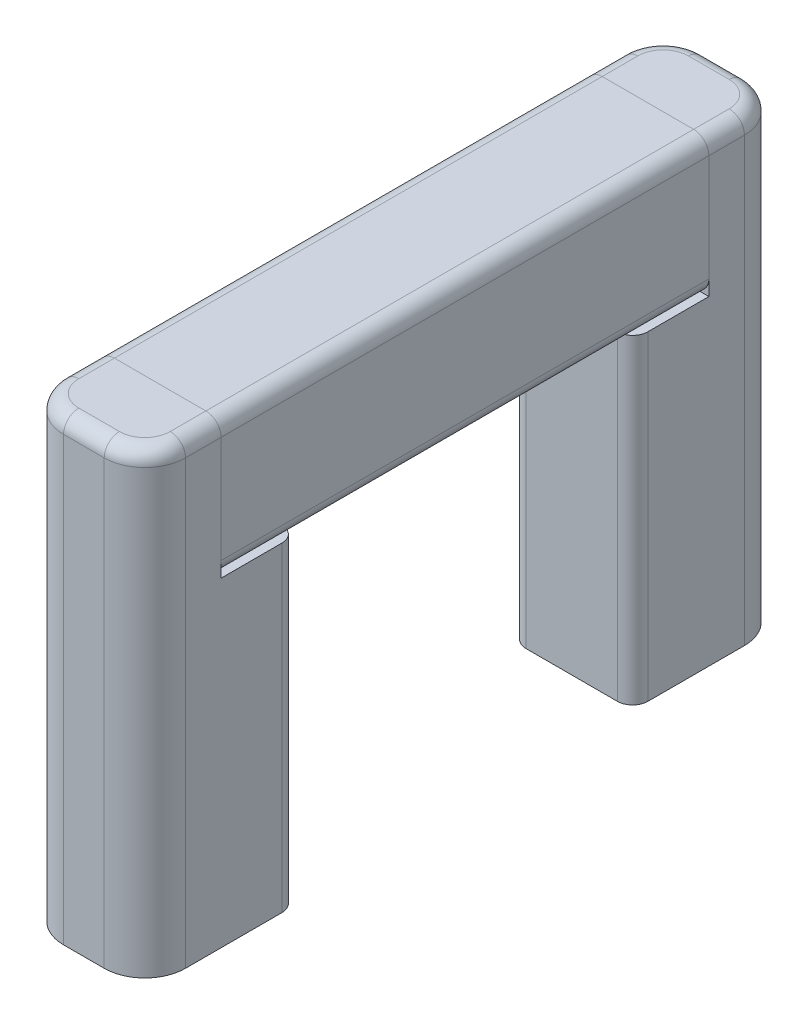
ISO-10303-21;
HEADER;
FILE_DESCRIPTION(('STEP AP214'),'2;1');
FILE_NAME('part.step','',(''),(''),'','','');
FILE_SCHEMA(('AUTOMOTIVE_DESIGN { 1 0 10303 214 1 1 1 1 }'));
ENDSEC;
DATA;
#1=APPLICATION_CONTEXT('core data for automotive mechanical design processes');
#2=APPLICATION_PROTOCOL_DEFINITION('international standard','automotive_design',2000,#1);
#3=PRODUCT_CONTEXT('',#1,'mechanical');
#4=PRODUCT('Part','Part','',(#3));
#5=PRODUCT_RELATED_PRODUCT_CATEGORY('part','',(#4));
#6=PRODUCT_DEFINITION_FORMATION('','',#4);
#7=PRODUCT_DEFINITION_CONTEXT('part definition',#1,'design');
#8=PRODUCT_DEFINITION('design','',#6,#7);
#9=PRODUCT_DEFINITION_SHAPE('','',#8);
#10=(LENGTH_UNIT() NAMED_UNIT(*) SI_UNIT(.MILLI.,.METRE.));
#11=(NAMED_UNIT(*) PLANE_ANGLE_UNIT() SI_UNIT($,.RADIAN.));
#12=(NAMED_UNIT(*) SI_UNIT($,.STERADIAN.) SOLID_ANGLE_UNIT());
#13=UNCERTAINTY_MEASURE_WITH_UNIT(LENGTH_MEASURE(1.E-05),#10,'distance_accuracy_value','');
#14=(GEOMETRIC_REPRESENTATION_CONTEXT(3) GLOBAL_UNCERTAINTY_ASSIGNED_CONTEXT((#13)) GLOBAL_UNIT_ASSIGNED_CONTEXT((#10,
#11,#12)) REPRESENTATION_CONTEXT('',''));
#15=CARTESIAN_POINT('',(0.,0.,0.));
#16=DIRECTION('',(0.,0.,1.));
#17=DIRECTION('',(1.,0.,0.));
#18=AXIS2_PLACEMENT_3D('',#15,#16,#17);
#19=CARTESIAN_POINT('',(-3.,3.50000000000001,16.));
#20=DIRECTION('',(0.,0.,1.));
#21=DIRECTION('',(1.,0.,0.));
#22=AXIS2_PLACEMENT_3D('',#19,#20,#21);
#23=PLANE('',#22);
#24=CARTESIAN_POINT('',(-3.,3.50000000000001,16.));
#25=DIRECTION('',(0.,0.,1.));
#26=DIRECTION('',(1.,0.,0.));
#27=AXIS2_PLACEMENT_3D('',#24,#25,#26);
#28=CIRCLE('',#27,1.);
#29=CARTESIAN_POINT('',(-3.,4.50000000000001,16.));
#30=VERTEX_POINT('',#29);
#31=CARTESIAN_POINT('',(-4.,3.50000000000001,16.));
#32=VERTEX_POINT('',#31);
#33=EDGE_CURVE('P0_E140',#30,#32,#28,.T.);
#34=ORIENTED_EDGE('',*,*,#33,.T.);
#35=DIRECTION('',(0.,-1.,0.));
#36=VECTOR('',#35,1.);
#37=CARTESIAN_POINT('',(-4.,3.50000000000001,16.));
#38=LINE('',#37,#36);
#39=CARTESIAN_POINT('',(-4.,-3.49999999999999,16.));
#40=VERTEX_POINT('',#39);
#41=EDGE_CURVE('P0_E129',#32,#40,#38,.T.);
#42=ORIENTED_EDGE('',*,*,#41,.T.);
#43=CARTESIAN_POINT('',(-3.,-3.49999999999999,16.));
#44=DIRECTION('',(0.,0.,1.));
#45=DIRECTION('',(1.,0.,0.));
#46=AXIS2_PLACEMENT_3D('',#43,#44,#45);
#47=CIRCLE('',#46,1.);
#48=CARTESIAN_POINT('',(-3.,-4.49999999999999,16.));
#49=VERTEX_POINT('',#48);
#50=EDGE_CURVE('P0_E139',#40,#49,#47,.T.);
#51=ORIENTED_EDGE('',*,*,#50,.T.);
#52=DIRECTION('',(1.,0.,0.));
#53=VECTOR('',#52,1.);
#54=CARTESIAN_POINT('',(-3.,-4.49999999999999,16.));
#55=LINE('',#54,#53);
#56=CARTESIAN_POINT('',(3.,-4.49999999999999,16.));
#57=VERTEX_POINT('',#56);
#58=EDGE_CURVE('P0_E224',#49,#57,#55,.T.);
#59=ORIENTED_EDGE('',*,*,#58,.T.);
#60=CARTESIAN_POINT('',(3.,-3.49999999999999,16.));
#61=DIRECTION('',(0.,0.,1.));
#62=DIRECTION('',(1.,0.,0.));
#63=AXIS2_PLACEMENT_3D('',#60,#61,#62);
#64=CIRCLE('',#63,1.);
#65=CARTESIAN_POINT('',(4.,-3.49999999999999,16.));
#66=VERTEX_POINT('',#65);
#67=EDGE_CURVE('P0_E226',#57,#66,#64,.T.);
#68=ORIENTED_EDGE('',*,*,#67,.T.);
#69=DIRECTION('',(0.,1.,0.));
#70=VECTOR('',#69,1.);
#71=CARTESIAN_POINT('',(4.,3.50000000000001,16.));
#72=LINE('',#71,#70);
#73=CARTESIAN_POINT('',(4.,3.50000000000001,16.));
#74=VERTEX_POINT('',#73);
#75=EDGE_CURVE('P0_E228',#66,#74,#72,.T.);
#76=ORIENTED_EDGE('',*,*,#75,.T.);
#77=CARTESIAN_POINT('',(3.,3.50000000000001,16.));
#78=DIRECTION('',(0.,0.,1.));
#79=DIRECTION('',(-1.,0.,0.));
#80=AXIS2_PLACEMENT_3D('',#77,#78,#79);
#81=CIRCLE('',#80,1.);
#82=CARTESIAN_POINT('',(3.,4.50000000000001,16.));
#83=VERTEX_POINT('',#82);
#84=EDGE_CURVE('P0_E230',#74,#83,#81,.T.);
#85=ORIENTED_EDGE('',*,*,#84,.T.);
#86=DIRECTION('',(-1.,0.,0.));
#87=VECTOR('',#86,1.);
#88=CARTESIAN_POINT('',(-3.,4.50000000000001,16.));
#89=LINE('',#88,#87);
#90=EDGE_CURVE('P0_E144',#83,#30,#89,.T.);
#91=ORIENTED_EDGE('',*,*,#90,.T.);
#92=EDGE_LOOP('',(#34,#42,#51,#59,#68,#76,#85,#91));
#93=FACE_BOUND('',#92,.T.);
#94=DIRECTION('',(-1.,0.,0.));
#95=VECTOR('',#94,1.);
#96=CARTESIAN_POINT('',(-1.33333333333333,1.5,16.));
#97=LINE('',#96,#95);
#98=CARTESIAN_POINT('',(0.833333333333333,1.5,16.));
#99=VERTEX_POINT('',#98);
#100=CARTESIAN_POINT('',(-0.833333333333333,1.5,16.));
#101=VERTEX_POINT('',#100);
#102=EDGE_CURVE('P0_E206',#99,#101,#97,.T.);
#103=ORIENTED_EDGE('',*,*,#102,.F.);
#104=CARTESIAN_POINT('',(0.833333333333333,1.,16.));
#105=DIRECTION('',(0.,0.,1.));
#106=DIRECTION('',(1.,0.,0.));
#107=AXIS2_PLACEMENT_3D('',#104,#105,#106);
#108=CIRCLE('',#107,0.5);
#109=CARTESIAN_POINT('',(1.33333333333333,1.,16.));
#110=VERTEX_POINT('',#109);
#111=EDGE_CURVE('P0_E187',#99,#110,#108,.F.);
#112=ORIENTED_EDGE('',*,*,#111,.T.);
#113=DIRECTION('',(0.,1.,0.));
#114=VECTOR('',#113,1.);
#115=CARTESIAN_POINT('',(1.33333333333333,-1.5,16.));
#116=LINE('',#115,#114);
#117=CARTESIAN_POINT('',(1.33333333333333,-0.999999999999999,16.));
#118=VERTEX_POINT('',#117);
#119=EDGE_CURVE('P0_E209',#118,#110,#116,.T.);
#120=ORIENTED_EDGE('',*,*,#119,.F.);
#121=CARTESIAN_POINT('',(0.833333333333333,-0.999999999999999,16.));
#122=DIRECTION('',(0.,0.,1.));
#123=DIRECTION('',(1.,0.,0.));
#124=AXIS2_PLACEMENT_3D('',#121,#122,#123);
#125=CIRCLE('',#124,0.5);
#126=CARTESIAN_POINT('',(0.833333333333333,-1.5,16.));
#127=VERTEX_POINT('',#126);
#128=EDGE_CURVE('P0_E183',#118,#127,#125,.F.);
#129=ORIENTED_EDGE('',*,*,#128,.T.);
#130=DIRECTION('',(1.,0.,0.));
#131=VECTOR('',#130,1.);
#132=CARTESIAN_POINT('',(-1.33333333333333,-1.5,16.));
#133=LINE('',#132,#131);
#134=CARTESIAN_POINT('',(-0.833333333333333,-1.5,16.));
#135=VERTEX_POINT('',#134);
#136=EDGE_CURVE('P0_E211',#135,#127,#133,.T.);
#137=ORIENTED_EDGE('',*,*,#136,.F.);
#138=CARTESIAN_POINT('',(-0.833333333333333,-0.999999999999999,16.));
#139=DIRECTION('',(0.,0.,1.));
#140=DIRECTION('',(1.,0.,0.));
#141=AXIS2_PLACEMENT_3D('',#138,#139,#140);
#142=CIRCLE('',#141,0.5);
#143=CARTESIAN_POINT('',(-1.33333333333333,-0.999999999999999,16.));
#144=VERTEX_POINT('',#143);
#145=EDGE_CURVE('P0_E179',#135,#144,#142,.F.);
#146=ORIENTED_EDGE('',*,*,#145,.T.);
#147=DIRECTION('',(0.,-1.,0.));
#148=VECTOR('',#147,1.);
#149=CARTESIAN_POINT('',(-1.33333333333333,-1.5,16.));
#150=LINE('',#149,#148);
#151=CARTESIAN_POINT('',(-1.33333333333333,1.,16.));
#152=VERTEX_POINT('',#151);
#153=EDGE_CURVE('P0_E208',#152,#144,#150,.T.);
#154=ORIENTED_EDGE('',*,*,#153,.F.);
#155=CARTESIAN_POINT('',(-0.833333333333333,0.999999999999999,16.));
#156=DIRECTION('',(0.,0.,1.));
#157=DIRECTION('',(1.,0.,0.));
#158=AXIS2_PLACEMENT_3D('',#155,#156,#157);
#159=CIRCLE('',#158,0.5);
#160=EDGE_CURVE('P0_E11',#152,#101,#159,.F.);
#161=ORIENTED_EDGE('',*,*,#160,.T.);
#162=EDGE_LOOP('',(#103,#112,#120,#129,#137,#146,#154,#161));
#163=FACE_BOUND('',#162,.T.);
#164=ADVANCED_FACE('P0_F16',(#93,#163),#23,.T.);
#165=CARTESIAN_POINT('',(-3.,3.50000000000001,-16.));
#166=DIRECTION('',(0.,0.,1.));
#167=DIRECTION('',(1.,0.,0.));
#168=AXIS2_PLACEMENT_3D('',#165,#166,#167);
#169=PLANE('',#168);
#170=CARTESIAN_POINT('',(-3.,3.50000000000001,-16.));
#171=DIRECTION('',(0.,0.,1.));
#172=DIRECTION('',(1.,0.,0.));
#173=AXIS2_PLACEMENT_3D('',#170,#171,#172);
#174=CIRCLE('',#173,1.);
#175=CARTESIAN_POINT('',(-3.,4.50000000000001,-16.));
#176=VERTEX_POINT('',#175);
#177=CARTESIAN_POINT('',(-4.,3.50000000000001,-16.));
#178=VERTEX_POINT('',#177);
#179=EDGE_CURVE('P0_E152',#176,#178,#174,.T.);
#180=ORIENTED_EDGE('',*,*,#179,.F.);
#181=DIRECTION('',(-1.,0.,0.));
#182=VECTOR('',#181,1.);
#183=CARTESIAN_POINT('',(-3.,4.50000000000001,-16.));
#184=LINE('',#183,#182);
#185=CARTESIAN_POINT('',(3.,4.50000000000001,-16.));
#186=VERTEX_POINT('',#185);
#187=EDGE_CURVE('P0_E148',#186,#176,#184,.T.);
#188=ORIENTED_EDGE('',*,*,#187,.F.);
#189=CARTESIAN_POINT('',(3.,3.50000000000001,-16.));
#190=DIRECTION('',(0.,0.,1.));
#191=DIRECTION('',(-1.,0.,0.));
#192=AXIS2_PLACEMENT_3D('',#189,#190,#191);
#193=CIRCLE('',#192,1.);
#194=CARTESIAN_POINT('',(4.,3.50000000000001,-16.));
#195=VERTEX_POINT('',#194);
#196=EDGE_CURVE('P0_E245',#195,#186,#193,.T.);
#197=ORIENTED_EDGE('',*,*,#196,.F.);
#198=DIRECTION('',(0.,1.,0.));
#199=VECTOR('',#198,1.);
#200=CARTESIAN_POINT('',(4.,3.50000000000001,-16.));
#201=LINE('',#200,#199);
#202=CARTESIAN_POINT('',(4.,-3.49999999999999,-16.));
#203=VERTEX_POINT('',#202);
#204=EDGE_CURVE('P0_E243',#203,#195,#201,.T.);
#205=ORIENTED_EDGE('',*,*,#204,.F.);
#206=CARTESIAN_POINT('',(3.,-3.49999999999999,-16.));
#207=DIRECTION('',(0.,0.,1.));
#208=DIRECTION('',(1.,0.,0.));
#209=AXIS2_PLACEMENT_3D('',#206,#207,#208);
#210=CIRCLE('',#209,1.);
#211=CARTESIAN_POINT('',(3.,-4.49999999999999,-16.));
#212=VERTEX_POINT('',#211);
#213=EDGE_CURVE('P0_E241',#212,#203,#210,.T.);
#214=ORIENTED_EDGE('',*,*,#213,.F.);
#215=DIRECTION('',(1.,0.,0.));
#216=VECTOR('',#215,1.);
#217=CARTESIAN_POINT('',(-3.,-4.49999999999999,-16.));
#218=LINE('',#217,#216);
#219=CARTESIAN_POINT('',(-3.,-4.49999999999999,-16.));
#220=VERTEX_POINT('',#219);
#221=EDGE_CURVE('P0_E239',#220,#212,#218,.T.);
#222=ORIENTED_EDGE('',*,*,#221,.F.);
#223=CARTESIAN_POINT('',(-3.,-3.49999999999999,-16.));
#224=DIRECTION('',(0.,0.,1.));
#225=DIRECTION('',(1.,0.,0.));
#226=AXIS2_PLACEMENT_3D('',#223,#224,#225);
#227=CIRCLE('',#226,1.);
#228=CARTESIAN_POINT('',(-4.,-3.49999999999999,-16.));
#229=VERTEX_POINT('',#228);
#230=EDGE_CURVE('P0_E237',#229,#220,#227,.T.);
#231=ORIENTED_EDGE('',*,*,#230,.F.);
#232=DIRECTION('',(0.,-1.,0.));
#233=VECTOR('',#232,1.);
#234=CARTESIAN_POINT('',(-4.,3.50000000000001,-16.));
#235=LINE('',#234,#233);
#236=EDGE_CURVE('P0_E235',#178,#229,#235,.T.);
#237=ORIENTED_EDGE('',*,*,#236,.F.);
#238=EDGE_LOOP('',(#180,#188,#197,#205,#214,#222,#231,#237));
#239=FACE_BOUND('',#238,.T.);
#240=DIRECTION('',(1.,0.,0.));
#241=VECTOR('',#240,1.);
#242=CARTESIAN_POINT('',(-1.33333333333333,-1.5,-16.));
#243=LINE('',#242,#241);
#244=CARTESIAN_POINT('',(-0.833333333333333,-1.5,-16.));
#245=VERTEX_POINT('',#244);
#246=CARTESIAN_POINT('',(0.833333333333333,-1.5,-16.));
#247=VERTEX_POINT('',#246);
#248=EDGE_CURVE('P0_E203',#245,#247,#243,.T.);
#249=ORIENTED_EDGE('',*,*,#248,.T.);
#250=CARTESIAN_POINT('',(0.833333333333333,-0.999999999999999,-16.));
#251=DIRECTION('',(0.,0.,1.));
#252=DIRECTION('',(1.,0.,0.));
#253=AXIS2_PLACEMENT_3D('',#250,#251,#252);
#254=CIRCLE('',#253,0.5);
#255=CARTESIAN_POINT('',(1.33333333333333,-0.999999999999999,-16.));
#256=VERTEX_POINT('',#255);
#257=EDGE_CURVE('P0_E181',#247,#256,#254,.T.);
#258=ORIENTED_EDGE('',*,*,#257,.T.);
#259=DIRECTION('',(0.,1.,0.));
#260=VECTOR('',#259,1.);
#261=CARTESIAN_POINT('',(1.33333333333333,-1.5,-16.));
#262=LINE('',#261,#260);
#263=CARTESIAN_POINT('',(1.33333333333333,1.,-16.));
#264=VERTEX_POINT('',#263);
#265=EDGE_CURVE('P0_E218',#256,#264,#262,.T.);
#266=ORIENTED_EDGE('',*,*,#265,.T.);
#267=CARTESIAN_POINT('',(0.833333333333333,1.,-16.));
#268=DIRECTION('',(0.,0.,1.));
#269=DIRECTION('',(1.,0.,0.));
#270=AXIS2_PLACEMENT_3D('',#267,#268,#269);
#271=CIRCLE('',#270,0.5);
#272=CARTESIAN_POINT('',(0.833333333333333,1.5,-16.));
#273=VERTEX_POINT('',#272);
#274=EDGE_CURVE('P0_E185',#264,#273,#271,.T.);
#275=ORIENTED_EDGE('',*,*,#274,.T.);
#276=DIRECTION('',(-1.,0.,0.));
#277=VECTOR('',#276,1.);
#278=CARTESIAN_POINT('',(-1.33333333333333,1.5,-16.));
#279=LINE('',#278,#277);
#280=CARTESIAN_POINT('',(-0.833333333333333,1.5,-16.));
#281=VERTEX_POINT('',#280);
#282=EDGE_CURVE('P0_E195',#273,#281,#279,.T.);
#283=ORIENTED_EDGE('',*,*,#282,.T.);
#284=CARTESIAN_POINT('',(-0.833333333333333,0.999999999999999,-16.));
#285=DIRECTION('',(0.,0.,1.));
#286=DIRECTION('',(1.,0.,0.));
#287=AXIS2_PLACEMENT_3D('',#284,#285,#286);
#288=CIRCLE('',#287,0.5);
#289=CARTESIAN_POINT('',(-1.33333333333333,1.,-16.));
#290=VERTEX_POINT('',#289);
#291=EDGE_CURVE('P0_E24',#281,#290,#288,.T.);
#292=ORIENTED_EDGE('',*,*,#291,.T.);
#293=DIRECTION('',(0.,-1.,0.));
#294=VECTOR('',#293,1.);
#295=CARTESIAN_POINT('',(-1.33333333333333,-1.5,-16.));
#296=LINE('',#295,#294);
#297=CARTESIAN_POINT('',(-1.33333333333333,-0.999999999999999,-16.));
#298=VERTEX_POINT('',#297);
#299=EDGE_CURVE('P0_E194',#290,#298,#296,.T.);
#300=ORIENTED_EDGE('',*,*,#299,.T.);
#301=CARTESIAN_POINT('',(-0.833333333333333,-0.999999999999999,-16.));
#302=DIRECTION('',(0.,0.,1.));
#303=DIRECTION('',(1.,0.,0.));
#304=AXIS2_PLACEMENT_3D('',#301,#302,#303);
#305=CIRCLE('',#304,0.5);
#306=EDGE_CURVE('P0_E177',#298,#245,#305,.T.);
#307=ORIENTED_EDGE('',*,*,#306,.T.);
#308=EDGE_LOOP('',(#249,#258,#266,#275,#283,#292,#300,#307));
#309=FACE_BOUND('',#308,.T.);
#310=ADVANCED_FACE('P0_F193',(#239,#309),#169,.F.);
#311=CARTESIAN_POINT('',(-3.,3.50000000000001,16.));
#312=DIRECTION('',(0.,0.,-1.));
#313=DIRECTION('',(-1.,0.,0.));
#314=AXIS2_PLACEMENT_3D('',#311,#312,#313);
#315=CYLINDRICAL_SURFACE('',#314,1.);
#316=ORIENTED_EDGE('',*,*,#179,.T.);
#317=DIRECTION('',(0.,0.,-1.));
#318=VECTOR('',#317,1.);
#319=CARTESIAN_POINT('',(-4.,3.50000000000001,16.));
#320=LINE('',#319,#318);
#321=EDGE_CURVE('P0_E133',#32,#178,#320,.T.);
#322=ORIENTED_EDGE('',*,*,#321,.F.);
#323=ORIENTED_EDGE('',*,*,#33,.F.);
#324=DIRECTION('',(0.,0.,-1.));
#325=VECTOR('',#324,1.);
#326=CARTESIAN_POINT('',(-3.,4.50000000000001,16.));
#327=LINE('',#326,#325);
#328=EDGE_CURVE('P0_E233',#30,#176,#327,.T.);
#329=ORIENTED_EDGE('',*,*,#328,.T.);
#330=EDGE_LOOP('',(#316,#322,#323,#329));
#331=FACE_BOUND('',#330,.T.);
#332=ADVANCED_FACE('P0_F150',(#331),#315,.T.);
#333=CARTESIAN_POINT('',(-4.,3.50000000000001,16.));
#334=DIRECTION('',(1.,0.,0.));
#335=DIRECTION('',(0.,0.,-1.));
#336=AXIS2_PLACEMENT_3D('',#333,#334,#335);
#337=PLANE('',#336);
#338=ORIENTED_EDGE('',*,*,#236,.T.);
#339=DIRECTION('',(0.,0.,-1.));
#340=VECTOR('',#339,1.);
#341=CARTESIAN_POINT('',(-4.,-3.49999999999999,16.));
#342=LINE('',#341,#340);
#343=EDGE_CURVE('P0_E136',#40,#229,#342,.T.);
#344=ORIENTED_EDGE('',*,*,#343,.F.);
#345=ORIENTED_EDGE('',*,*,#41,.F.);
#346=ORIENTED_EDGE('',*,*,#321,.T.);
#347=EDGE_LOOP('',(#338,#344,#345,#346));
#348=FACE_BOUND('',#347,.T.);
#349=ADVANCED_FACE('P0_F131',(#348),#337,.F.);
#350=CARTESIAN_POINT('',(-3.,-3.49999999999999,16.));
#351=DIRECTION('',(0.,0.,-1.));
#352=DIRECTION('',(-1.,0.,0.));
#353=AXIS2_PLACEMENT_3D('',#350,#351,#352);
#354=CYLINDRICAL_SURFACE('',#353,1.);
#355=ORIENTED_EDGE('',*,*,#230,.T.);
#356=DIRECTION('',(0.,0.,-1.));
#357=VECTOR('',#356,1.);
#358=CARTESIAN_POINT('',(-3.,-4.49999999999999,16.));
#359=LINE('',#358,#357);
#360=EDGE_CURVE('P0_E157',#49,#220,#359,.T.);
#361=ORIENTED_EDGE('',*,*,#360,.F.);
#362=ORIENTED_EDGE('',*,*,#50,.F.);
#363=ORIENTED_EDGE('',*,*,#343,.T.);
#364=EDGE_LOOP('',(#355,#361,#362,#363));
#365=FACE_BOUND('',#364,.T.);
#366=ADVANCED_FACE('P0_F283',(#365),#354,.T.);
#367=CARTESIAN_POINT('',(-3.,-4.49999999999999,16.));
#368=DIRECTION('',(0.,1.,0.));
#369=DIRECTION('',(0.,0.,1.));
#370=AXIS2_PLACEMENT_3D('',#367,#368,#369);
#371=PLANE('',#370);
#372=ORIENTED_EDGE('',*,*,#221,.T.);
#373=DIRECTION('',(0.,0.,-1.));
#374=VECTOR('',#373,1.);
#375=CARTESIAN_POINT('',(3.,-4.49999999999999,16.));
#376=LINE('',#375,#374);
#377=EDGE_CURVE('P0_E258',#57,#212,#376,.T.);
#378=ORIENTED_EDGE('',*,*,#377,.F.);
#379=ORIENTED_EDGE('',*,*,#58,.F.);
#380=ORIENTED_EDGE('',*,*,#360,.T.);
#381=EDGE_LOOP('',(#372,#378,#379,#380));
#382=FACE_BOUND('',#381,.T.);
#383=ADVANCED_FACE('P0_F265',(#382),#371,.F.);
#384=CARTESIAN_POINT('',(3.,-3.49999999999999,16.));
#385=DIRECTION('',(0.,0.,-1.));
#386=DIRECTION('',(-1.,0.,0.));
#387=AXIS2_PLACEMENT_3D('',#384,#385,#386);
#388=CYLINDRICAL_SURFACE('',#387,1.);
#389=ORIENTED_EDGE('',*,*,#213,.T.);
#390=DIRECTION('',(0.,0.,-1.));
#391=VECTOR('',#390,1.);
#392=CARTESIAN_POINT('',(4.,-3.49999999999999,16.));
#393=LINE('',#392,#391);
#394=EDGE_CURVE('P0_E255',#66,#203,#393,.T.);
#395=ORIENTED_EDGE('',*,*,#394,.F.);
#396=ORIENTED_EDGE('',*,*,#67,.F.);
#397=ORIENTED_EDGE('',*,*,#377,.T.);
#398=EDGE_LOOP('',(#389,#395,#396,#397));
#399=FACE_BOUND('',#398,.T.);
#400=ADVANCED_FACE('P0_F275',(#399),#388,.T.);
#401=CARTESIAN_POINT('',(4.,3.50000000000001,16.));
#402=DIRECTION('',(-1.,0.,0.));
#403=DIRECTION('',(0.,0.,1.));
#404=AXIS2_PLACEMENT_3D('',#401,#402,#403);
#405=PLANE('',#404);
#406=ORIENTED_EDGE('',*,*,#204,.T.);
#407=DIRECTION('',(0.,0.,-1.));
#408=VECTOR('',#407,1.);
#409=CARTESIAN_POINT('',(4.,3.50000000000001,16.));
#410=LINE('',#409,#408);
#411=EDGE_CURVE('P0_E252',#74,#195,#410,.T.);
#412=ORIENTED_EDGE('',*,*,#411,.F.);
#413=ORIENTED_EDGE('',*,*,#75,.F.);
#414=ORIENTED_EDGE('',*,*,#394,.T.);
#415=EDGE_LOOP('',(#406,#412,#413,#414));
#416=FACE_BOUND('',#415,.T.);
#417=ADVANCED_FACE('P0_F279',(#416),#405,.F.);
#418=CARTESIAN_POINT('',(3.,3.50000000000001,16.));
#419=DIRECTION('',(0.,0.,-1.));
#420=DIRECTION('',(-1.,0.,0.));
#421=AXIS2_PLACEMENT_3D('',#418,#419,#420);
#422=CYLINDRICAL_SURFACE('',#421,1.);
#423=ORIENTED_EDGE('',*,*,#196,.T.);
#424=DIRECTION('',(0.,0.,-1.));
#425=VECTOR('',#424,1.);
#426=CARTESIAN_POINT('',(3.,4.50000000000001,16.));
#427=LINE('',#426,#425);
#428=EDGE_CURVE('P0_E249',#83,#186,#427,.T.);
#429=ORIENTED_EDGE('',*,*,#428,.F.);
#430=ORIENTED_EDGE('',*,*,#84,.F.);
#431=ORIENTED_EDGE('',*,*,#411,.T.);
#432=EDGE_LOOP('',(#423,#429,#430,#431));
#433=FACE_BOUND('',#432,.T.);
#434=ADVANCED_FACE('P0_F306',(#433),#422,.T.);
#435=CARTESIAN_POINT('',(-3.,4.50000000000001,16.));
#436=DIRECTION('',(0.,-1.,0.));
#437=DIRECTION('',(0.,0.,-1.));
#438=AXIS2_PLACEMENT_3D('',#435,#436,#437);
#439=PLANE('',#438);
#440=ORIENTED_EDGE('',*,*,#187,.T.);
#441=ORIENTED_EDGE('',*,*,#328,.F.);
#442=ORIENTED_EDGE('',*,*,#90,.F.);
#443=ORIENTED_EDGE('',*,*,#428,.T.);
#444=EDGE_LOOP('',(#440,#441,#442,#443));
#445=FACE_BOUND('',#444,.T.);
#446=ADVANCED_FACE('P0_F303',(#445),#439,.F.);
#447=CARTESIAN_POINT('',(1.33333333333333,-1.5,16.));
#448=DIRECTION('',(-1.,0.,0.));
#449=DIRECTION('',(0.,0.,1.));
#450=AXIS2_PLACEMENT_3D('',#447,#448,#449);
#451=PLANE('',#450);
#452=ORIENTED_EDGE('',*,*,#265,.F.);
#453=DIRECTION('',(0.,0.,-1.));
#454=VECTOR('',#453,1.);
#455=CARTESIAN_POINT('',(1.33333333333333,-0.999999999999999,16.));
#456=LINE('',#455,#454);
#457=EDGE_CURVE('P0_E171',#256,#118,#456,.F.);
#458=ORIENTED_EDGE('',*,*,#457,.T.);
#459=ORIENTED_EDGE('',*,*,#119,.T.);
#460=DIRECTION('',(0.,0.,-1.));
#461=VECTOR('',#460,1.);
#462=CARTESIAN_POINT('',(1.33333333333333,1.,-16.));
#463=LINE('',#462,#461);
#464=EDGE_CURVE('P0_E168',#110,#264,#463,.T.);
#465=ORIENTED_EDGE('',*,*,#464,.T.);
#466=EDGE_LOOP('',(#452,#458,#459,#465));
#467=FACE_BOUND('',#466,.T.);
#468=ADVANCED_FACE('P0_F300',(#467),#451,.T.);
#469=CARTESIAN_POINT('',(-1.33333333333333,1.5,16.));
#470=DIRECTION('',(0.,-1.,0.));
#471=DIRECTION('',(1.,0.,0.));
#472=AXIS2_PLACEMENT_3D('',#469,#470,#471);
#473=PLANE('',#472);
#474=ORIENTED_EDGE('',*,*,#282,.F.);
#475=DIRECTION('',(0.,0.,-1.));
#476=VECTOR('',#475,1.);
#477=CARTESIAN_POINT('',(0.833333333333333,1.5,16.));
#478=LINE('',#477,#476);
#479=EDGE_CURVE('P0_E36',#273,#99,#478,.F.);
#480=ORIENTED_EDGE('',*,*,#479,.T.);
#481=ORIENTED_EDGE('',*,*,#102,.T.);
#482=DIRECTION('',(0.,0.,-1.));
#483=VECTOR('',#482,1.);
#484=CARTESIAN_POINT('',(-0.833333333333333,1.5,-16.));
#485=LINE('',#484,#483);
#486=EDGE_CURVE('P0_E173',#101,#281,#485,.T.);
#487=ORIENTED_EDGE('',*,*,#486,.T.);
#488=EDGE_LOOP('',(#474,#480,#481,#487));
#489=FACE_BOUND('',#488,.T.);
#490=ADVANCED_FACE('P0_F205',(#489),#473,.T.);
#491=CARTESIAN_POINT('',(-1.33333333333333,-1.5,16.));
#492=DIRECTION('',(1.,0.,0.));
#493=DIRECTION('',(0.,0.,-1.));
#494=AXIS2_PLACEMENT_3D('',#491,#492,#493);
#495=PLANE('',#494);
#496=ORIENTED_EDGE('',*,*,#153,.T.);
#497=DIRECTION('',(0.,0.,-1.));
#498=VECTOR('',#497,1.);
#499=CARTESIAN_POINT('',(-1.33333333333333,-0.999999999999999,-16.));
#500=LINE('',#499,#498);
#501=EDGE_CURVE('P0_E155',#144,#298,#500,.T.);
#502=ORIENTED_EDGE('',*,*,#501,.T.);
#503=ORIENTED_EDGE('',*,*,#299,.F.);
#504=DIRECTION('',(0.,0.,-1.));
#505=VECTOR('',#504,1.);
#506=CARTESIAN_POINT('',(-1.33333333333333,0.999999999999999,16.));
#507=LINE('',#506,#505);
#508=EDGE_CURVE('P0_E153',#290,#152,#507,.F.);
#509=ORIENTED_EDGE('',*,*,#508,.T.);
#510=EDGE_LOOP('',(#496,#502,#503,#509));
#511=FACE_BOUND('',#510,.T.);
#512=ADVANCED_FACE('P0_F201',(#511),#495,.T.);
#513=CARTESIAN_POINT('',(-1.33333333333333,-1.5,16.));
#514=DIRECTION('',(0.,1.,0.));
#515=DIRECTION('',(0.,0.,1.));
#516=AXIS2_PLACEMENT_3D('',#513,#514,#515);
#517=PLANE('',#516);
#518=ORIENTED_EDGE('',*,*,#248,.F.);
#519=DIRECTION('',(0.,0.,-1.));
#520=VECTOR('',#519,1.);
#521=CARTESIAN_POINT('',(-0.833333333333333,-1.5,16.));
#522=LINE('',#521,#520);
#523=EDGE_CURVE('P0_E166',#245,#135,#522,.F.);
#524=ORIENTED_EDGE('',*,*,#523,.T.);
#525=ORIENTED_EDGE('',*,*,#136,.T.);
#526=DIRECTION('',(0.,0.,-1.));
#527=VECTOR('',#526,1.);
#528=CARTESIAN_POINT('',(0.833333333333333,-1.5,-16.));
#529=LINE('',#528,#527);
#530=EDGE_CURVE('P0_E163',#127,#247,#529,.T.);
#531=ORIENTED_EDGE('',*,*,#530,.T.);
#532=EDGE_LOOP('',(#518,#524,#525,#531));
#533=FACE_BOUND('',#532,.T.);
#534=ADVANCED_FACE('P0_F355',(#533),#517,.T.);
#535=CARTESIAN_POINT('',(-0.833333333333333,-0.999999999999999,16.));
#536=DIRECTION('',(0.,0.,1.));
#537=DIRECTION('',(1.,0.,0.));
#538=AXIS2_PLACEMENT_3D('',#535,#536,#537);
#539=CYLINDRICAL_SURFACE('',#538,0.5);
#540=ORIENTED_EDGE('',*,*,#145,.F.);
#541=ORIENTED_EDGE('',*,*,#523,.F.);
#542=ORIENTED_EDGE('',*,*,#306,.F.);
#543=ORIENTED_EDGE('',*,*,#501,.F.);
#544=EDGE_LOOP('',(#540,#541,#542,#543));
#545=FACE_BOUND('',#544,.T.);
#546=ADVANCED_FACE('P0_F363',(#545),#539,.F.);
#547=CARTESIAN_POINT('',(0.833333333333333,-0.999999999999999,16.));
#548=DIRECTION('',(0.,0.,1.));
#549=DIRECTION('',(1.,0.,0.));
#550=AXIS2_PLACEMENT_3D('',#547,#548,#549);
#551=CYLINDRICAL_SURFACE('',#550,0.5);
#552=ORIENTED_EDGE('',*,*,#128,.F.);
#553=ORIENTED_EDGE('',*,*,#457,.F.);
#554=ORIENTED_EDGE('',*,*,#257,.F.);
#555=ORIENTED_EDGE('',*,*,#530,.F.);
#556=EDGE_LOOP('',(#552,#553,#554,#555));
#557=FACE_BOUND('',#556,.T.);
#558=ADVANCED_FACE('P0_F372',(#557),#551,.F.);
#559=CARTESIAN_POINT('',(0.833333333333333,1.,16.));
#560=DIRECTION('',(0.,0.,1.));
#561=DIRECTION('',(1.,0.,0.));
#562=AXIS2_PLACEMENT_3D('',#559,#560,#561);
#563=CYLINDRICAL_SURFACE('',#562,0.5);
#564=ORIENTED_EDGE('',*,*,#111,.F.);
#565=ORIENTED_EDGE('',*,*,#479,.F.);
#566=ORIENTED_EDGE('',*,*,#274,.F.);
#567=ORIENTED_EDGE('',*,*,#464,.F.);
#568=EDGE_LOOP('',(#564,#565,#566,#567));
#569=FACE_BOUND('',#568,.T.);
#570=ADVANCED_FACE('P0_F381',(#569),#563,.F.);
#571=CARTESIAN_POINT('',(-0.833333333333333,0.999999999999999,16.));
#572=DIRECTION('',(0.,0.,1.));
#573=DIRECTION('',(1.,0.,0.));
#574=AXIS2_PLACEMENT_3D('',#571,#572,#573);
#575=CYLINDRICAL_SURFACE('',#574,0.5);
#576=ORIENTED_EDGE('',*,*,#160,.F.);
#577=ORIENTED_EDGE('',*,*,#508,.F.);
#578=ORIENTED_EDGE('',*,*,#291,.F.);
#579=ORIENTED_EDGE('',*,*,#486,.F.);
#580=EDGE_LOOP('',(#576,#577,#578,#579));
#581=FACE_BOUND('',#580,.T.);
#582=ADVANCED_FACE('P0_F18',(#581),#575,.F.);
#583=CLOSED_SHELL('',(#164,#310,#332,#349,#366,#383,#400,#417,#434,#446,#468,#490,#512,#534,
#546,#558,#570,#582));
#584=MANIFOLD_SOLID_BREP('P0_B1',#583);
#585=CARTESIAN_POINT('',(0.,-25.5,-16.));
#586=DIRECTION('',(0.,1.,0.));
#587=DIRECTION('',(-1.,0.,0.));
#588=AXIS2_PLACEMENT_3D('',#585,#586,#587);
#589=CYLINDRICAL_SURFACE('',#588,3.24999999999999);
#590=CARTESIAN_POINT('',(0.,-11.2769088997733,-16.));
#591=DIRECTION('',(0.,1.,0.));
#592=DIRECTION('',(-1.,0.,0.));
#593=AXIS2_PLACEMENT_3D('',#590,#591,#592);
#594=CIRCLE('',#593,3.24999999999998);
#595=CARTESIAN_POINT('',(-3.24999999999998,-11.2769088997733,-16.));
#596=VERTEX_POINT('',#595);
#597=EDGE_CURVE('P1_E11',#596,#596,#594,.T.);
#598=ORIENTED_EDGE('',*,*,#597,.F.);
#599=EDGE_LOOP('',(#598));
#600=FACE_BOUND('',#599,.T.);
#601=CARTESIAN_POINT('',(0.,-25.5,-16.));
#602=DIRECTION('',(0.,1.,0.));
#603=DIRECTION('',(-1.,0.,0.));
#604=AXIS2_PLACEMENT_3D('',#601,#602,#603);
#605=CIRCLE('',#604,3.25);
#606=CARTESIAN_POINT('',(-3.25,-25.5,-16.));
#607=VERTEX_POINT('',#606);
#608=EDGE_CURVE('P1_E51',#607,#607,#605,.T.);
#609=ORIENTED_EDGE('',*,*,#608,.T.);
#610=EDGE_LOOP('',(#609));
#611=FACE_BOUND('',#610,.T.);
#612=ADVANCED_FACE('P1_F16',(#600,#611),#589,.T.);
#613=CARTESIAN_POINT('',(0.,-11.2769088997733,-16.));
#614=DIRECTION('',(0.,1.,0.));
#615=DIRECTION('',(-1.,0.,0.));
#616=AXIS2_PLACEMENT_3D('',#613,#614,#615);
#617=TOROIDAL_SURFACE('',#616,2.25,0.999999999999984);
#618=CARTESIAN_POINT('',(0.,-10.2807142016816,-16.));
#619=DIRECTION('',(0.,1.,0.));
#620=DIRECTION('',(-1.,0.,0.));
#621=AXIS2_PLACEMENT_3D('',#618,#619,#620);
#622=CIRCLE('',#621,2.33715574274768);
#623=CARTESIAN_POINT('',(-2.33715574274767,-10.2807142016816,-16.));
#624=VERTEX_POINT('',#623);
#625=EDGE_CURVE('P1_E23',#624,#624,#622,.T.);
#626=ORIENTED_EDGE('',*,*,#625,.F.);
#627=EDGE_LOOP('',(#626));
#628=FACE_BOUND('',#627,.T.);
#629=ORIENTED_EDGE('',*,*,#597,.T.);
#630=EDGE_LOOP('',(#629));
#631=FACE_BOUND('',#630,.T.);
#632=ADVANCED_FACE('P1_F33',(#628,#631),#617,.T.);
#633=CARTESIAN_POINT('',(0.,-10.2807142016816,-16.));
#634=DIRECTION('',(0.,-1.,0.));
#635=DIRECTION('',(1.,0.,0.));
#636=AXIS2_PLACEMENT_3D('',#633,#634,#635);
#637=CONICAL_SURFACE('',#636,2.33715574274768,1.48352986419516);
#638=CARTESIAN_POINT('',(0.,-10.0762395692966,-16.));
#639=VERTEX_POINT('',#638);
#640=VERTEX_LOOP('',#639);
#641=FACE_BOUND('',#640,.T.);
#642=ORIENTED_EDGE('',*,*,#625,.T.);
#643=EDGE_LOOP('',(#642));
#644=FACE_BOUND('',#643,.T.);
#645=ADVANCED_FACE('P1_F29',(#641,#644),#637,.T.);
#646=CARTESIAN_POINT('',(0.,-13.5762395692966,-16.));
#647=DIRECTION('',(0.,-1.,0.));
#648=DIRECTION('',(1.,0.,0.));
#649=AXIS2_PLACEMENT_3D('',#646,#647,#648);
#650=CONICAL_SURFACE('',#649,0.,1.04719755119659);
#651=CARTESIAN_POINT('',(0.,-14.5,-16.));
#652=DIRECTION('',(0.,1.,0.));
#653=DIRECTION('',(-1.,0.,0.));
#654=AXIS2_PLACEMENT_3D('',#651,#652,#653);
#655=CIRCLE('',#654,1.6);
#656=CARTESIAN_POINT('',(-1.6,-14.5,-16.));
#657=VERTEX_POINT('',#656);
#658=EDGE_CURVE('P1_E38',#657,#657,#655,.T.);
#659=ORIENTED_EDGE('',*,*,#658,.F.);
#660=EDGE_LOOP('',(#659));
#661=FACE_BOUND('',#660,.T.);
#662=CARTESIAN_POINT('',(0.,-13.5762395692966,-16.));
#663=VERTEX_POINT('',#662);
#664=VERTEX_LOOP('',#663);
#665=FACE_BOUND('',#664,.T.);
#666=ADVANCED_FACE('P1_F32',(#661,#665),#650,.F.);
#667=CARTESIAN_POINT('',(0.,-25.5,-16.));
#668=DIRECTION('',(0.,1.,0.));
#669=DIRECTION('',(-1.,0.,0.));
#670=AXIS2_PLACEMENT_3D('',#667,#668,#669);
#671=CYLINDRICAL_SURFACE('',#670,1.6);
#672=CARTESIAN_POINT('',(0.,-17.5,-16.));
#673=DIRECTION('',(0.,1.,0.));
#674=DIRECTION('',(-1.,0.,0.));
#675=AXIS2_PLACEMENT_3D('',#672,#673,#674);
#676=CIRCLE('',#675,1.6);
#677=CARTESIAN_POINT('',(-1.6,-17.5,-16.));
#678=VERTEX_POINT('',#677);
#679=EDGE_CURVE('P1_E40',#678,#678,#676,.T.);
#680=ORIENTED_EDGE('',*,*,#679,.F.);
#681=EDGE_LOOP('',(#680));
#682=FACE_BOUND('',#681,.T.);
#683=ORIENTED_EDGE('',*,*,#658,.T.);
#684=EDGE_LOOP('',(#683));
#685=FACE_BOUND('',#684,.T.);
#686=ADVANCED_FACE('P1_F71',(#682,#685),#671,.F.);
#687=CARTESIAN_POINT('',(0.,-17.5,-14.));
#688=DIRECTION('',(0.,1.,0.));
#689=DIRECTION('',(-1.,0.,0.));
#690=AXIS2_PLACEMENT_3D('',#687,#688,#689);
#691=PLANE('',#690);
#692=CARTESIAN_POINT('',(0.,-17.5,-16.));
#693=DIRECTION('',(0.,1.,0.));
#694=DIRECTION('',(-1.,0.,0.));
#695=AXIS2_PLACEMENT_3D('',#692,#693,#694);
#696=CIRCLE('',#695,2.);
#697=CARTESIAN_POINT('',(-2.,-17.5,-16.));
#698=VERTEX_POINT('',#697);
#699=EDGE_CURVE('P1_E45',#698,#698,#696,.T.);
#700=ORIENTED_EDGE('',*,*,#699,.F.);
#701=EDGE_LOOP('',(#700));
#702=FACE_BOUND('',#701,.T.);
#703=ORIENTED_EDGE('',*,*,#679,.T.);
#704=EDGE_LOOP('',(#703));
#705=FACE_BOUND('',#704,.T.);
#706=ADVANCED_FACE('P1_F65',(#702,#705),#691,.F.);
#707=CARTESIAN_POINT('',(0.,-25.5,-16.));
#708=DIRECTION('',(0.,1.,0.));
#709=DIRECTION('',(-1.,0.,0.));
#710=AXIS2_PLACEMENT_3D('',#707,#708,#709);
#711=CYLINDRICAL_SURFACE('',#710,2.);
#712=CARTESIAN_POINT('',(0.,-25.5,-16.));
#713=DIRECTION('',(0.,1.,0.));
#714=DIRECTION('',(-1.,0.,0.));
#715=AXIS2_PLACEMENT_3D('',#712,#713,#714);
#716=CIRCLE('',#715,2.);
#717=CARTESIAN_POINT('',(-2.,-25.5,-16.));
#718=VERTEX_POINT('',#717);
#719=EDGE_CURVE('P1_E48',#718,#718,#716,.T.);
#720=ORIENTED_EDGE('',*,*,#719,.F.);
#721=EDGE_LOOP('',(#720));
#722=FACE_BOUND('',#721,.T.);
#723=ORIENTED_EDGE('',*,*,#699,.T.);
#724=EDGE_LOOP('',(#723));
#725=FACE_BOUND('',#724,.T.);
#726=ADVANCED_FACE('P1_F59',(#722,#725),#711,.F.);
#727=CARTESIAN_POINT('',(0.,-25.5,-14.));
#728=DIRECTION('',(0.,1.,0.));
#729=DIRECTION('',(-1.,0.,0.));
#730=AXIS2_PLACEMENT_3D('',#727,#728,#729);
#731=PLANE('',#730);
#732=ORIENTED_EDGE('',*,*,#608,.F.);
#733=EDGE_LOOP('',(#732));
#734=FACE_BOUND('',#733,.T.);
#735=ORIENTED_EDGE('',*,*,#719,.T.);
#736=EDGE_LOOP('',(#735));
#737=FACE_BOUND('',#736,.T.);
#738=ADVANCED_FACE('P1_F56',(#734,#737),#731,.F.);
#739=CLOSED_SHELL('',(#612,#632,#645,#666,#686,#706,#726,#738));
#740=MANIFOLD_SOLID_BREP('P1_B1',#739);
#741=CARTESIAN_POINT('',(-1.33333333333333,-25.5,-18.3333333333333));
#742=DIRECTION('',(0.,1.,0.));
#743=DIRECTION('',(-1.,0.,0.));
#744=AXIS2_PLACEMENT_3D('',#741,#742,#743);
#745=PLANE('',#744);
#746=DIRECTION('',(0.,0.,-1.));
#747=VECTOR('',#746,1.);
#748=CARTESIAN_POINT('',(4.,-25.5,-18.3333333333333));
#749=LINE('',#748,#747);
#750=CARTESIAN_POINT('',(4.,-25.5,-12.));
#751=VERTEX_POINT('',#750);
#752=CARTESIAN_POINT('',(4.,-25.5,-18.3333333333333));
#753=VERTEX_POINT('',#752);
#754=EDGE_CURVE('P2_E225',#751,#753,#749,.T.);
#755=ORIENTED_EDGE('',*,*,#754,.F.);
#756=CARTESIAN_POINT('',(3.,-25.5,-12.));
#757=DIRECTION('',(0.,1.,0.));
#758=DIRECTION('',(-1.,0.,0.));
#759=AXIS2_PLACEMENT_3D('',#756,#757,#758);
#760=CIRCLE('',#759,1.);
#761=CARTESIAN_POINT('',(3.,-25.5,-11.));
#762=VERTEX_POINT('',#761);
#763=EDGE_CURVE('P2_E276',#751,#762,#760,.F.);
#764=ORIENTED_EDGE('',*,*,#763,.T.);
#765=DIRECTION('',(1.,0.,0.));
#766=VECTOR('',#765,1.);
#767=CARTESIAN_POINT('',(4.,-25.5,-11.));
#768=LINE('',#767,#766);
#769=CARTESIAN_POINT('',(-3.,-25.5,-11.));
#770=VERTEX_POINT('',#769);
#771=EDGE_CURVE('P2_E220',#770,#762,#768,.T.);
#772=ORIENTED_EDGE('',*,*,#771,.F.);
#773=CARTESIAN_POINT('',(-3.,-25.5,-12.));
#774=DIRECTION('',(0.,1.,0.));
#775=DIRECTION('',(-1.,0.,0.));
#776=AXIS2_PLACEMENT_3D('',#773,#774,#775);
#777=CIRCLE('',#776,1.);
#778=CARTESIAN_POINT('',(-4.,-25.5,-12.));
#779=VERTEX_POINT('',#778);
#780=EDGE_CURVE('P2_E274',#770,#779,#777,.F.);
#781=ORIENTED_EDGE('',*,*,#780,.T.);
#782=DIRECTION('',(0.,0.,1.));
#783=VECTOR('',#782,1.);
#784=CARTESIAN_POINT('',(-4.,-25.5,-18.3333333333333));
#785=LINE('',#784,#783);
#786=CARTESIAN_POINT('',(-4.,-25.5,-18.3333333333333));
#787=VERTEX_POINT('',#786);
#788=EDGE_CURVE('P2_E237',#787,#779,#785,.T.);
#789=ORIENTED_EDGE('',*,*,#788,.F.);
#790=CARTESIAN_POINT('',(-1.33333333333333,-25.5,-18.3333333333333));
#791=DIRECTION('',(0.,1.,0.));
#792=DIRECTION('',(-1.,0.,0.));
#793=AXIS2_PLACEMENT_3D('',#790,#791,#792);
#794=CIRCLE('',#793,2.66666666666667);
#795=CARTESIAN_POINT('',(-1.33333333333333,-25.5,-21.));
#796=VERTEX_POINT('',#795);
#797=EDGE_CURVE('P2_E234',#796,#787,#794,.T.);
#798=ORIENTED_EDGE('',*,*,#797,.F.);
#799=DIRECTION('',(-1.,0.,0.));
#800=VECTOR('',#799,1.);
#801=CARTESIAN_POINT('',(1.33333333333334,-25.5,-21.));
#802=LINE('',#801,#800);
#803=CARTESIAN_POINT('',(1.33333333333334,-25.5,-21.));
#804=VERTEX_POINT('',#803);
#805=EDGE_CURVE('P2_E231',#804,#796,#802,.T.);
#806=ORIENTED_EDGE('',*,*,#805,.F.);
#807=CARTESIAN_POINT('',(1.33333333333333,-25.5,-18.3333333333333));
#808=DIRECTION('',(0.,1.,0.));
#809=DIRECTION('',(-1.,0.,0.));
#810=AXIS2_PLACEMENT_3D('',#807,#808,#809);
#811=CIRCLE('',#810,2.66666666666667);
#812=EDGE_CURVE('P2_E228',#753,#804,#811,.T.);
#813=ORIENTED_EDGE('',*,*,#812,.F.);
#814=EDGE_LOOP('',(#755,#764,#772,#781,#789,#798,#806,#813));
#815=FACE_BOUND('',#814,.T.);
#816=CARTESIAN_POINT('',(0.,-25.5,-16.));
#817=DIRECTION('',(0.,1.,0.));
#818=DIRECTION('',(0.,0.,-1.));
#819=AXIS2_PLACEMENT_3D('',#816,#817,#818);
#820=CIRCLE('',#819,3.25);
#821=CARTESIAN_POINT('',(0.,-25.5,-19.25));
#822=VERTEX_POINT('',#821);
#823=EDGE_CURVE('P2_E172',#822,#822,#820,.T.);
#824=ORIENTED_EDGE('',*,*,#823,.T.);
#825=EDGE_LOOP('',(#824));
#826=FACE_BOUND('',#825,.T.);
#827=ADVANCED_FACE('P2_F16',(#815,#826),#745,.F.);
#828=CARTESIAN_POINT('',(4.,-4.5,-16.));
#829=DIRECTION('',(0.,0.,-1.));
#830=DIRECTION('',(-1.,0.,0.));
#831=AXIS2_PLACEMENT_3D('',#828,#829,#830);
#832=PLANE('',#831);
#833=DIRECTION('',(0.,1.,0.));
#834=VECTOR('',#833,1.);
#835=CARTESIAN_POINT('',(4.,-4.5,-16.));
#836=LINE('',#835,#834);
#837=CARTESIAN_POINT('',(4.,-4.5,-16.));
#838=VERTEX_POINT('',#837);
#839=CARTESIAN_POINT('',(4.,3.5,-16.));
#840=VERTEX_POINT('',#839);
#841=EDGE_CURVE('P2_E217',#838,#840,#836,.T.);
#842=ORIENTED_EDGE('',*,*,#841,.T.);
#843=CARTESIAN_POINT('',(3.,3.5,-16.));
#844=DIRECTION('',(0.,0.,-1.));
#845=DIRECTION('',(-1.,0.,0.));
#846=AXIS2_PLACEMENT_3D('',#843,#844,#845);
#847=CIRCLE('',#846,1.);
#848=CARTESIAN_POINT('',(3.,4.5,-16.));
#849=VERTEX_POINT('',#848);
#850=EDGE_CURVE('P2_E266',#840,#849,#847,.F.);
#851=ORIENTED_EDGE('',*,*,#850,.T.);
#852=DIRECTION('',(-1.,0.,0.));
#853=VECTOR('',#852,1.);
#854=CARTESIAN_POINT('',(4.,4.5,-16.));
#855=LINE('',#854,#853);
#856=CARTESIAN_POINT('',(-3.,4.5,-16.));
#857=VERTEX_POINT('',#856);
#858=EDGE_CURVE('P2_E191',#849,#857,#855,.T.);
#859=ORIENTED_EDGE('',*,*,#858,.T.);
#860=CARTESIAN_POINT('',(-3.,3.5,-16.));
#861=DIRECTION('',(0.,0.,-1.));
#862=DIRECTION('',(-1.,0.,0.));
#863=AXIS2_PLACEMENT_3D('',#860,#861,#862);
#864=CIRCLE('',#863,1.);
#865=CARTESIAN_POINT('',(-4.,3.5,-16.));
#866=VERTEX_POINT('',#865);
#867=EDGE_CURVE('P2_E264',#857,#866,#864,.F.);
#868=ORIENTED_EDGE('',*,*,#867,.T.);
#869=DIRECTION('',(0.,1.,0.));
#870=VECTOR('',#869,1.);
#871=CARTESIAN_POINT('',(-4.,-4.5,-16.));
#872=LINE('',#871,#870);
#873=CARTESIAN_POINT('',(-4.,-4.5,-16.));
#874=VERTEX_POINT('',#873);
#875=EDGE_CURVE('P2_E214',#874,#866,#872,.T.);
#876=ORIENTED_EDGE('',*,*,#875,.F.);
#877=DIRECTION('',(-1.,0.,0.));
#878=VECTOR('',#877,1.);
#879=CARTESIAN_POINT('',(4.,-4.5,-16.));
#880=LINE('',#879,#878);
#881=EDGE_CURVE('P2_E203',#838,#874,#880,.T.);
#882=ORIENTED_EDGE('',*,*,#881,.F.);
#883=EDGE_LOOP('',(#842,#851,#859,#868,#876,#882));
#884=FACE_BOUND('',#883,.T.);
#885=DIRECTION('',(0.,-1.,0.));
#886=VECTOR('',#885,1.);
#887=CARTESIAN_POINT('',(-1.33333333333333,1.5,-16.));
#888=LINE('',#887,#886);
#889=CARTESIAN_POINT('',(-1.33333333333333,0.999999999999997,-16.));
#890=VERTEX_POINT('',#889);
#891=CARTESIAN_POINT('',(-1.33333333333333,-1.,-16.));
#892=VERTEX_POINT('',#891);
#893=EDGE_CURVE('P2_E192',#890,#892,#888,.T.);
#894=ORIENTED_EDGE('',*,*,#893,.F.);
#895=CARTESIAN_POINT('',(-0.833333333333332,0.999999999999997,-16.));
#896=DIRECTION('',(0.,0.,-1.));
#897=DIRECTION('',(-1.,0.,0.));
#898=AXIS2_PLACEMENT_3D('',#895,#896,#897);
#899=CIRCLE('',#898,0.5);
#900=CARTESIAN_POINT('',(-0.833333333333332,1.5,-16.));
#901=VERTEX_POINT('',#900);
#902=EDGE_CURVE('P2_E11',#890,#901,#899,.T.);
#903=ORIENTED_EDGE('',*,*,#902,.T.);
#904=DIRECTION('',(-1.,0.,0.));
#905=VECTOR('',#904,1.);
#906=CARTESIAN_POINT('',(-1.33333333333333,1.5,-16.));
#907=LINE('',#906,#905);
#908=CARTESIAN_POINT('',(0.833333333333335,1.5,-16.));
#909=VERTEX_POINT('',#908);
#910=EDGE_CURVE('P2_E182',#909,#901,#907,.T.);
#911=ORIENTED_EDGE('',*,*,#910,.F.);
#912=CARTESIAN_POINT('',(0.833333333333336,0.999999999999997,-16.));
#913=DIRECTION('',(0.,0.,-1.));
#914=DIRECTION('',(-1.,0.,0.));
#915=AXIS2_PLACEMENT_3D('',#912,#913,#914);
#916=CIRCLE('',#915,0.5);
#917=CARTESIAN_POINT('',(1.33333333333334,0.999999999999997,-16.));
#918=VERTEX_POINT('',#917);
#919=EDGE_CURVE('P2_E329',#909,#918,#916,.T.);
#920=ORIENTED_EDGE('',*,*,#919,.T.);
#921=DIRECTION('',(0.,1.,0.));
#922=VECTOR('',#921,1.);
#923=CARTESIAN_POINT('',(1.33333333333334,1.5,-16.));
#924=LINE('',#923,#922);
#925=CARTESIAN_POINT('',(1.33333333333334,-1.,-16.));
#926=VERTEX_POINT('',#925);
#927=EDGE_CURVE('P2_E198',#926,#918,#924,.T.);
#928=ORIENTED_EDGE('',*,*,#927,.F.);
#929=CARTESIAN_POINT('',(0.833333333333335,-1.,-16.));
#930=DIRECTION('',(0.,0.,-1.));
#931=DIRECTION('',(-1.,0.,0.));
#932=AXIS2_PLACEMENT_3D('',#929,#930,#931);
#933=CIRCLE('',#932,0.5);
#934=CARTESIAN_POINT('',(0.833333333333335,-1.5,-16.));
#935=VERTEX_POINT('',#934);
#936=EDGE_CURVE('P2_E327',#926,#935,#933,.T.);
#937=ORIENTED_EDGE('',*,*,#936,.T.);
#938=DIRECTION('',(1.,0.,0.));
#939=VECTOR('',#938,1.);
#940=CARTESIAN_POINT('',(-1.33333333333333,-1.5,-16.));
#941=LINE('',#940,#939);
#942=CARTESIAN_POINT('',(-0.833333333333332,-1.5,-16.));
#943=VERTEX_POINT('',#942);
#944=EDGE_CURVE('P2_E194',#943,#935,#941,.T.);
#945=ORIENTED_EDGE('',*,*,#944,.F.);
#946=CARTESIAN_POINT('',(-0.833333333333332,-1.,-16.));
#947=DIRECTION('',(0.,0.,-1.));
#948=DIRECTION('',(-1.,0.,0.));
#949=AXIS2_PLACEMENT_3D('',#946,#947,#948);
#950=CIRCLE('',#949,0.5);
#951=EDGE_CURVE('P2_E24',#943,#892,#950,.T.);
#952=ORIENTED_EDGE('',*,*,#951,.T.);
#953=EDGE_LOOP('',(#894,#903,#911,#920,#928,#937,#945,#952));
#954=FACE_BOUND('',#953,.T.);
#955=ADVANCED_FACE('P2_F332',(#884,#954),#832,.F.);
#956=CARTESIAN_POINT('',(4.,4.5,-11.));
#957=DIRECTION('',(0.,0.,-1.));
#958=DIRECTION('',(-1.,0.,0.));
#959=AXIS2_PLACEMENT_3D('',#956,#957,#958);
#960=PLANE('',#959);
#961=ORIENTED_EDGE('',*,*,#771,.T.);
#962=DIRECTION('',(0.,-1.,0.));
#963=VECTOR('',#962,1.);
#964=CARTESIAN_POINT('',(3.,4.5,-11.));
#965=LINE('',#964,#963);
#966=CARTESIAN_POINT('',(3.,-4.5,-11.));
#967=VERTEX_POINT('',#966);
#968=EDGE_CURVE('P2_E281',#762,#967,#965,.F.);
#969=ORIENTED_EDGE('',*,*,#968,.T.);
#970=DIRECTION('',(1.,0.,0.));
#971=VECTOR('',#970,1.);
#972=CARTESIAN_POINT('',(4.,-4.5,-11.));
#973=LINE('',#972,#971);
#974=CARTESIAN_POINT('',(-3.,-4.5,-11.));
#975=VERTEX_POINT('',#974);
#976=EDGE_CURVE('P2_E209',#975,#967,#973,.T.);
#977=ORIENTED_EDGE('',*,*,#976,.F.);
#978=DIRECTION('',(0.,-1.,0.));
#979=VECTOR('',#978,1.);
#980=CARTESIAN_POINT('',(-3.,4.5,-11.));
#981=LINE('',#980,#979);
#982=EDGE_CURVE('P2_E278',#975,#770,#981,.T.);
#983=ORIENTED_EDGE('',*,*,#982,.T.);
#984=EDGE_LOOP('',(#961,#969,#977,#983));
#985=FACE_BOUND('',#984,.T.);
#986=ADVANCED_FACE('P2_F376',(#985),#960,.F.);
#987=CARTESIAN_POINT('',(4.,4.5,-18.3333333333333));
#988=DIRECTION('',(-1.,0.,0.));
#989=DIRECTION('',(0.,0.,1.));
#990=AXIS2_PLACEMENT_3D('',#987,#988,#989);
#991=PLANE('',#990);
#992=DIRECTION('',(0.,-1.,0.));
#993=VECTOR('',#992,1.);
#994=CARTESIAN_POINT('',(4.,4.5,-18.3333333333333));
#995=LINE('',#994,#993);
#996=CARTESIAN_POINT('',(4.,3.5,-18.3333333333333));
#997=VERTEX_POINT('',#996);
#998=EDGE_CURVE('P2_E246',#997,#753,#995,.T.);
#999=ORIENTED_EDGE('',*,*,#998,.F.);
#1000=DIRECTION('',(0.,0.,-1.));
#1001=VECTOR('',#1000,1.);
#1002=CARTESIAN_POINT('',(4.,3.5,-16.));
#1003=LINE('',#1002,#1001);
#1004=EDGE_CURVE('P2_E262',#997,#840,#1003,.F.);
#1005=ORIENTED_EDGE('',*,*,#1004,.T.);
#1006=ORIENTED_EDGE('',*,*,#841,.F.);
#1007=DIRECTION('',(0.,0.,-1.));
#1008=VECTOR('',#1007,1.);
#1009=CARTESIAN_POINT('',(4.,-4.5,-16.));
#1010=LINE('',#1009,#1008);
#1011=CARTESIAN_POINT('',(4.,-4.5,-12.));
#1012=VERTEX_POINT('',#1011);
#1013=EDGE_CURVE('P2_E212',#1012,#838,#1010,.T.);
#1014=ORIENTED_EDGE('',*,*,#1013,.F.);
#1015=DIRECTION('',(0.,-1.,0.));
#1016=VECTOR('',#1015,1.);
#1017=CARTESIAN_POINT('',(4.,4.5,-12.));
#1018=LINE('',#1017,#1016);
#1019=EDGE_CURVE('P2_E259',#1012,#751,#1018,.T.);
#1020=ORIENTED_EDGE('',*,*,#1019,.T.);
#1021=ORIENTED_EDGE('',*,*,#754,.T.);
#1022=EDGE_LOOP('',(#999,#1005,#1006,#1014,#1020,#1021));
#1023=FACE_BOUND('',#1022,.T.);
#1024=ADVANCED_FACE('P2_F399',(#1023),#991,.F.);
#1025=CARTESIAN_POINT('',(1.33333333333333,4.5,-18.3333333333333));
#1026=DIRECTION('',(0.,-1.,0.));
#1027=DIRECTION('',(1.,0.,0.));
#1028=AXIS2_PLACEMENT_3D('',#1025,#1026,#1027);
#1029=CYLINDRICAL_SURFACE('',#1028,2.66666666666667);
#1030=DIRECTION('',(0.,-1.,0.));
#1031=VECTOR('',#1030,1.);
#1032=CARTESIAN_POINT('',(1.33333333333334,4.5,-21.));
#1033=LINE('',#1032,#1031);
#1034=CARTESIAN_POINT('',(1.33333333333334,3.5,-21.));
#1035=VERTEX_POINT('',#1034);
#1036=EDGE_CURVE('P2_E244',#1035,#804,#1033,.T.);
#1037=ORIENTED_EDGE('',*,*,#1036,.F.);
#1038=CARTESIAN_POINT('',(1.33333333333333,3.5,-18.3333333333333));
#1039=DIRECTION('',(0.,1.,0.));
#1040=DIRECTION('',(-1.,0.,0.));
#1041=AXIS2_PLACEMENT_3D('',#1038,#1039,#1040);
#1042=CIRCLE('',#1041,2.66666666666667);
#1043=EDGE_CURVE('P2_E268',#1035,#997,#1042,.F.);
#1044=ORIENTED_EDGE('',*,*,#1043,.T.);
#1045=ORIENTED_EDGE('',*,*,#998,.T.);
#1046=ORIENTED_EDGE('',*,*,#812,.T.);
#1047=EDGE_LOOP('',(#1037,#1044,#1045,#1046));
#1048=FACE_BOUND('',#1047,.T.);
#1049=ADVANCED_FACE('P2_F395',(#1048),#1029,.T.);
#1050=CARTESIAN_POINT('',(1.33333333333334,4.5,-21.));
#1051=DIRECTION('',(0.,0.,1.));
#1052=DIRECTION('',(1.,0.,0.));
#1053=AXIS2_PLACEMENT_3D('',#1050,#1051,#1052);
#1054=PLANE('',#1053);
#1055=DIRECTION('',(0.,-1.,0.));
#1056=VECTOR('',#1055,1.);
#1057=CARTESIAN_POINT('',(-1.33333333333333,4.5,-21.));
#1058=LINE('',#1057,#1056);
#1059=CARTESIAN_POINT('',(-1.33333333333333,3.5,-21.));
#1060=VERTEX_POINT('',#1059);
#1061=EDGE_CURVE('P2_E242',#1060,#796,#1058,.T.);
#1062=ORIENTED_EDGE('',*,*,#1061,.F.);
#1063=DIRECTION('',(-1.,0.,0.));
#1064=VECTOR('',#1063,1.);
#1065=CARTESIAN_POINT('',(1.33333333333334,3.5,-21.));
#1066=LINE('',#1065,#1064);
#1067=EDGE_CURVE('P2_E270',#1060,#1035,#1066,.F.);
#1068=ORIENTED_EDGE('',*,*,#1067,.T.);
#1069=ORIENTED_EDGE('',*,*,#1036,.T.);
#1070=ORIENTED_EDGE('',*,*,#805,.T.);
#1071=EDGE_LOOP('',(#1062,#1068,#1069,#1070));
#1072=FACE_BOUND('',#1071,.T.);
#1073=ADVANCED_FACE('P2_F391',(#1072),#1054,.F.);
#1074=CARTESIAN_POINT('',(-1.33333333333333,4.5,-18.3333333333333));
#1075=DIRECTION('',(0.,-1.,0.));
#1076=DIRECTION('',(1.,0.,0.));
#1077=AXIS2_PLACEMENT_3D('',#1074,#1075,#1076);
#1078=CYLINDRICAL_SURFACE('',#1077,2.66666666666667);
#1079=DIRECTION('',(0.,-1.,0.));
#1080=VECTOR('',#1079,1.);
#1081=CARTESIAN_POINT('',(-4.,4.5,-18.3333333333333));
#1082=LINE('',#1081,#1080);
#1083=CARTESIAN_POINT('',(-4.,3.5,-18.3333333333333));
#1084=VERTEX_POINT('',#1083);
#1085=EDGE_CURVE('P2_E240',#1084,#787,#1082,.T.);
#1086=ORIENTED_EDGE('',*,*,#1085,.F.);
#1087=CARTESIAN_POINT('',(-1.33333333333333,3.5,-18.3333333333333));
#1088=DIRECTION('',(0.,1.,0.));
#1089=DIRECTION('',(-1.,0.,0.));
#1090=AXIS2_PLACEMENT_3D('',#1087,#1088,#1089);
#1091=CIRCLE('',#1090,2.66666666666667);
#1092=EDGE_CURVE('P2_E272',#1084,#1060,#1091,.F.);
#1093=ORIENTED_EDGE('',*,*,#1092,.T.);
#1094=ORIENTED_EDGE('',*,*,#1061,.T.);
#1095=ORIENTED_EDGE('',*,*,#797,.T.);
#1096=EDGE_LOOP('',(#1086,#1093,#1094,#1095));
#1097=FACE_BOUND('',#1096,.T.);
#1098=ADVANCED_FACE('P2_F387',(#1097),#1078,.T.);
#1099=CARTESIAN_POINT('',(-4.,4.5,-18.3333333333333));
#1100=DIRECTION('',(1.,0.,0.));
#1101=DIRECTION('',(0.,0.,-1.));
#1102=AXIS2_PLACEMENT_3D('',#1099,#1100,#1101);
#1103=PLANE('',#1102);
#1104=ORIENTED_EDGE('',*,*,#788,.T.);
#1105=DIRECTION('',(0.,-1.,0.));
#1106=VECTOR('',#1105,1.);
#1107=CARTESIAN_POINT('',(-4.,4.5,-12.));
#1108=LINE('',#1107,#1106);
#1109=CARTESIAN_POINT('',(-4.,-4.5,-12.));
#1110=VERTEX_POINT('',#1109);
#1111=EDGE_CURVE('P2_E289',#779,#1110,#1108,.F.);
#1112=ORIENTED_EDGE('',*,*,#1111,.T.);
#1113=DIRECTION('',(0.,0.,1.));
#1114=VECTOR('',#1113,1.);
#1115=CARTESIAN_POINT('',(-4.,-4.5,-16.));
#1116=LINE('',#1115,#1114);
#1117=EDGE_CURVE('P2_E206',#874,#1110,#1116,.T.);
#1118=ORIENTED_EDGE('',*,*,#1117,.F.);
#1119=ORIENTED_EDGE('',*,*,#875,.T.);
#1120=DIRECTION('',(0.,0.,1.));
#1121=VECTOR('',#1120,1.);
#1122=CARTESIAN_POINT('',(-4.,3.5,-18.3333333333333));
#1123=LINE('',#1122,#1121);
#1124=EDGE_CURVE('P2_E287',#866,#1084,#1123,.F.);
#1125=ORIENTED_EDGE('',*,*,#1124,.T.);
#1126=ORIENTED_EDGE('',*,*,#1085,.T.);
#1127=EDGE_LOOP('',(#1104,#1112,#1118,#1119,#1125,#1126));
#1128=FACE_BOUND('',#1127,.T.);
#1129=ADVANCED_FACE('P2_F384',(#1128),#1103,.F.);
#1130=CARTESIAN_POINT('',(-1.33333333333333,4.5,-18.3333333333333));
#1131=DIRECTION('',(0.,1.,0.));
#1132=DIRECTION('',(-1.,0.,0.));
#1133=AXIS2_PLACEMENT_3D('',#1130,#1131,#1132);
#1134=PLANE('',#1133);
#1135=ORIENTED_EDGE('',*,*,#858,.F.);
#1136=DIRECTION('',(0.,0.,-1.));
#1137=VECTOR('',#1136,1.);
#1138=CARTESIAN_POINT('',(3.,4.5,-18.3333333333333));
#1139=LINE('',#1138,#1137);
#1140=CARTESIAN_POINT('',(3.,4.5,-18.3333333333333));
#1141=VERTEX_POINT('',#1140);
#1142=EDGE_CURVE('P2_E256',#849,#1141,#1139,.T.);
#1143=ORIENTED_EDGE('',*,*,#1142,.T.);
#1144=CARTESIAN_POINT('',(1.33333333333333,4.5,-18.3333333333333));
#1145=DIRECTION('',(0.,1.,0.));
#1146=DIRECTION('',(-1.,0.,0.));
#1147=AXIS2_PLACEMENT_3D('',#1144,#1145,#1146);
#1148=CIRCLE('',#1147,1.66666666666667);
#1149=CARTESIAN_POINT('',(1.33333333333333,4.5,-20.));
#1150=VERTEX_POINT('',#1149);
#1151=EDGE_CURVE('P2_E254',#1141,#1150,#1148,.T.);
#1152=ORIENTED_EDGE('',*,*,#1151,.T.);
#1153=DIRECTION('',(-1.,0.,0.));
#1154=VECTOR('',#1153,1.);
#1155=CARTESIAN_POINT('',(-1.33333333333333,4.5,-20.));
#1156=LINE('',#1155,#1154);
#1157=CARTESIAN_POINT('',(-1.33333333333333,4.5,-20.));
#1158=VERTEX_POINT('',#1157);
#1159=EDGE_CURVE('P2_E252',#1150,#1158,#1156,.T.);
#1160=ORIENTED_EDGE('',*,*,#1159,.T.);
#1161=CARTESIAN_POINT('',(-1.33333333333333,4.5,-18.3333333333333));
#1162=DIRECTION('',(0.,1.,0.));
#1163=DIRECTION('',(-1.,0.,0.));
#1164=AXIS2_PLACEMENT_3D('',#1161,#1162,#1163);
#1165=CIRCLE('',#1164,1.66666666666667);
#1166=CARTESIAN_POINT('',(-3.,4.5,-18.3333333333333));
#1167=VERTEX_POINT('',#1166);
#1168=EDGE_CURVE('P2_E250',#1158,#1167,#1165,.T.);
#1169=ORIENTED_EDGE('',*,*,#1168,.T.);
#1170=DIRECTION('',(0.,0.,1.));
#1171=VECTOR('',#1170,1.);
#1172=CARTESIAN_POINT('',(-3.,4.5,-16.));
#1173=LINE('',#1172,#1171);
#1174=EDGE_CURVE('P2_E248',#1167,#857,#1173,.T.);
#1175=ORIENTED_EDGE('',*,*,#1174,.T.);
#1176=EDGE_LOOP('',(#1135,#1143,#1152,#1160,#1169,#1175));
#1177=FACE_BOUND('',#1176,.T.);
#1178=ADVANCED_FACE('P2_F383',(#1177),#1134,.T.);
#1179=CARTESIAN_POINT('',(-4.,-4.5,-16.));
#1180=DIRECTION('',(0.,1.,0.));
#1181=DIRECTION('',(-1.,0.,0.));
#1182=AXIS2_PLACEMENT_3D('',#1179,#1180,#1181);
#1183=PLANE('',#1182);
#1184=ORIENTED_EDGE('',*,*,#976,.T.);
#1185=CARTESIAN_POINT('',(3.,-4.5,-12.));
#1186=DIRECTION('',(0.,1.,0.));
#1187=DIRECTION('',(-1.,0.,0.));
#1188=AXIS2_PLACEMENT_3D('',#1185,#1186,#1187);
#1189=CIRCLE('',#1188,1.);
#1190=EDGE_CURVE('P2_E285',#967,#1012,#1189,.T.);
#1191=ORIENTED_EDGE('',*,*,#1190,.T.);
#1192=ORIENTED_EDGE('',*,*,#1013,.T.);
#1193=ORIENTED_EDGE('',*,*,#881,.T.);
#1194=ORIENTED_EDGE('',*,*,#1117,.T.);
#1195=CARTESIAN_POINT('',(-3.,-4.5,-12.));
#1196=DIRECTION('',(0.,1.,0.));
#1197=DIRECTION('',(-1.,0.,0.));
#1198=AXIS2_PLACEMENT_3D('',#1195,#1196,#1197);
#1199=CIRCLE('',#1198,1.);
#1200=EDGE_CURVE('P2_E283',#1110,#975,#1199,.T.);
#1201=ORIENTED_EDGE('',*,*,#1200,.T.);
#1202=EDGE_LOOP('',(#1184,#1191,#1192,#1193,#1194,#1201));
#1203=FACE_BOUND('',#1202,.T.);
#1204=ADVANCED_FACE('P2_F444',(#1203),#1183,.T.);
#1205=CARTESIAN_POINT('',(-1.33333333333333,1.5,-7.00000000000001));
#1206=DIRECTION('',(1.,0.,0.));
#1207=DIRECTION('',(0.,1.,0.));
#1208=AXIS2_PLACEMENT_3D('',#1205,#1206,#1207);
#1209=PLANE('',#1208);
#1210=ORIENTED_EDGE('',*,*,#893,.T.);
#1211=DIRECTION('',(0.,0.,-1.));
#1212=VECTOR('',#1211,1.);
#1213=CARTESIAN_POINT('',(-1.33333333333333,-1.,-7.00000000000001));
#1214=LINE('',#1213,#1212);
#1215=CARTESIAN_POINT('',(-1.33333333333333,-1.,-7.00000000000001));
#1216=VERTEX_POINT('',#1215);
#1217=EDGE_CURVE('P2_E325',#892,#1216,#1214,.F.);
#1218=ORIENTED_EDGE('',*,*,#1217,.T.);
#1219=DIRECTION('',(0.,-1.,0.));
#1220=VECTOR('',#1219,1.);
#1221=CARTESIAN_POINT('',(-1.33333333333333,1.5,-7.00000000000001));
#1222=LINE('',#1221,#1220);
#1223=CARTESIAN_POINT('',(-1.33333333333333,0.999999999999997,-7.00000000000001));
#1224=VERTEX_POINT('',#1223);
#1225=EDGE_CURVE('P2_E178',#1224,#1216,#1222,.T.);
#1226=ORIENTED_EDGE('',*,*,#1225,.F.);
#1227=DIRECTION('',(0.,0.,-1.));
#1228=VECTOR('',#1227,1.);
#1229=CARTESIAN_POINT('',(-1.33333333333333,0.999999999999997,-7.00000000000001));
#1230=LINE('',#1229,#1228);
#1231=EDGE_CURVE('P2_E323',#1224,#890,#1230,.T.);
#1232=ORIENTED_EDGE('',*,*,#1231,.T.);
#1233=EDGE_LOOP('',(#1210,#1218,#1226,#1232));
#1234=FACE_BOUND('',#1233,.T.);
#1235=ADVANCED_FACE('P2_F351',(#1234),#1209,.F.);
#1236=CARTESIAN_POINT('',(-1.33333333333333,-1.5,-7.00000000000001));
#1237=DIRECTION('',(0.,1.,0.));
#1238=DIRECTION('',(-1.,0.,0.));
#1239=AXIS2_PLACEMENT_3D('',#1236,#1237,#1238);
#1240=PLANE('',#1239);
#1241=ORIENTED_EDGE('',*,*,#944,.T.);
#1242=DIRECTION('',(0.,0.,-1.));
#1243=VECTOR('',#1242,1.);
#1244=CARTESIAN_POINT('',(0.833333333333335,-1.5,-7.00000000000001));
#1245=LINE('',#1244,#1243);
#1246=CARTESIAN_POINT('',(0.833333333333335,-1.5,-7.00000000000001));
#1247=VERTEX_POINT('',#1246);
#1248=EDGE_CURVE('P2_E308',#935,#1247,#1245,.F.);
#1249=ORIENTED_EDGE('',*,*,#1248,.T.);
#1250=DIRECTION('',(1.,0.,0.));
#1251=VECTOR('',#1250,1.);
#1252=CARTESIAN_POINT('',(-1.33333333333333,-1.5,-7.00000000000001));
#1253=LINE('',#1252,#1251);
#1254=CARTESIAN_POINT('',(-0.833333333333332,-1.5,-7.00000000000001));
#1255=VERTEX_POINT('',#1254);
#1256=EDGE_CURVE('P2_E181',#1255,#1247,#1253,.T.);
#1257=ORIENTED_EDGE('',*,*,#1256,.F.);
#1258=DIRECTION('',(0.,0.,-1.));
#1259=VECTOR('',#1258,1.);
#1260=CARTESIAN_POINT('',(-0.833333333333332,-1.5,-7.00000000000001));
#1261=LINE('',#1260,#1259);
#1262=EDGE_CURVE('P2_E305',#1255,#943,#1261,.T.);
#1263=ORIENTED_EDGE('',*,*,#1262,.T.);
#1264=EDGE_LOOP('',(#1241,#1249,#1257,#1263));
#1265=FACE_BOUND('',#1264,.T.);
#1266=ADVANCED_FACE('P2_F359',(#1265),#1240,.F.);
#1267=CARTESIAN_POINT('',(1.33333333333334,1.5,-7.00000000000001));
#1268=DIRECTION('',(-1.,0.,0.));
#1269=DIRECTION('',(0.,0.,1.));
#1270=AXIS2_PLACEMENT_3D('',#1267,#1268,#1269);
#1271=PLANE('',#1270);
#1272=DIRECTION('',(0.,1.,0.));
#1273=VECTOR('',#1272,1.);
#1274=CARTESIAN_POINT('',(1.33333333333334,1.5,-7.00000000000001));
#1275=LINE('',#1274,#1273);
#1276=CARTESIAN_POINT('',(1.33333333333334,-1.,-7.00000000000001));
#1277=VERTEX_POINT('',#1276);
#1278=CARTESIAN_POINT('',(1.33333333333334,0.999999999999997,-7.00000000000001));
#1279=VERTEX_POINT('',#1278);
#1280=EDGE_CURVE('P2_E185',#1277,#1279,#1275,.T.);
#1281=ORIENTED_EDGE('',*,*,#1280,.F.);
#1282=DIRECTION('',(0.,0.,-1.));
#1283=VECTOR('',#1282,1.);
#1284=CARTESIAN_POINT('',(1.33333333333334,-1.,-7.00000000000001));
#1285=LINE('',#1284,#1283);
#1286=EDGE_CURVE('P2_E302',#1277,#926,#1285,.T.);
#1287=ORIENTED_EDGE('',*,*,#1286,.T.);
#1288=ORIENTED_EDGE('',*,*,#927,.T.);
#1289=DIRECTION('',(0.,0.,-1.));
#1290=VECTOR('',#1289,1.);
#1291=CARTESIAN_POINT('',(1.33333333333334,0.999999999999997,-7.00000000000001));
#1292=LINE('',#1291,#1290);
#1293=EDGE_CURVE('P2_E291',#918,#1279,#1292,.F.);
#1294=ORIENTED_EDGE('',*,*,#1293,.T.);
#1295=EDGE_LOOP('',(#1281,#1287,#1288,#1294));
#1296=FACE_BOUND('',#1295,.T.);
#1297=ADVANCED_FACE('P2_F338',(#1296),#1271,.F.);
#1298=CARTESIAN_POINT('',(-1.33333333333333,1.5,-7.00000000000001));
#1299=DIRECTION('',(0.,-1.,0.));
#1300=DIRECTION('',(1.,0.,0.));
#1301=AXIS2_PLACEMENT_3D('',#1298,#1299,#1300);
#1302=PLANE('',#1301);
#1303=DIRECTION('',(-1.,0.,0.));
#1304=VECTOR('',#1303,1.);
#1305=CARTESIAN_POINT('',(-1.33333333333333,1.5,-7.00000000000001));
#1306=LINE('',#1305,#1304);
#1307=CARTESIAN_POINT('',(0.833333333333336,1.5,-7.00000000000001));
#1308=VERTEX_POINT('',#1307);
#1309=CARTESIAN_POINT('',(-0.833333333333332,1.5,-7.00000000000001));
#1310=VERTEX_POINT('',#1309);
#1311=EDGE_CURVE('P2_E188',#1308,#1310,#1306,.T.);
#1312=ORIENTED_EDGE('',*,*,#1311,.F.);
#1313=DIRECTION('',(0.,0.,-1.));
#1314=VECTOR('',#1313,1.);
#1315=CARTESIAN_POINT('',(0.833333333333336,1.5,-7.00000000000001));
#1316=LINE('',#1315,#1314);
#1317=EDGE_CURVE('P2_E320',#1308,#909,#1316,.T.);
#1318=ORIENTED_EDGE('',*,*,#1317,.T.);
#1319=ORIENTED_EDGE('',*,*,#910,.T.);
#1320=DIRECTION('',(0.,0.,-1.));
#1321=VECTOR('',#1320,1.);
#1322=CARTESIAN_POINT('',(-0.833333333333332,1.5,-7.00000000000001));
#1323=LINE('',#1322,#1321);
#1324=EDGE_CURVE('P2_E318',#901,#1310,#1323,.F.);
#1325=ORIENTED_EDGE('',*,*,#1324,.T.);
#1326=EDGE_LOOP('',(#1312,#1318,#1319,#1325));
#1327=FACE_BOUND('',#1326,.T.);
#1328=ADVANCED_FACE('P2_F347',(#1327),#1302,.F.);
#1329=CARTESIAN_POINT('',(-1.33333333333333,-1.5,-7.00000000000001));
#1330=DIRECTION('',(0.,0.,1.));
#1331=DIRECTION('',(1.,0.,0.));
#1332=AXIS2_PLACEMENT_3D('',#1329,#1330,#1331);
#1333=PLANE('',#1332);
#1334=ORIENTED_EDGE('',*,*,#1256,.T.);
#1335=CARTESIAN_POINT('',(0.833333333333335,-1.,-7.00000000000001));
#1336=DIRECTION('',(0.,0.,1.));
#1337=DIRECTION('',(1.,0.,0.));
#1338=AXIS2_PLACEMENT_3D('',#1335,#1336,#1337);
#1339=CIRCLE('',#1338,0.5);
#1340=EDGE_CURVE('P2_E316',#1247,#1277,#1339,.T.);
#1341=ORIENTED_EDGE('',*,*,#1340,.T.);
#1342=ORIENTED_EDGE('',*,*,#1280,.T.);
#1343=CARTESIAN_POINT('',(0.833333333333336,0.999999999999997,-7.00000000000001));
#1344=DIRECTION('',(0.,0.,1.));
#1345=DIRECTION('',(1.,0.,0.));
#1346=AXIS2_PLACEMENT_3D('',#1343,#1344,#1345);
#1347=CIRCLE('',#1346,0.5);
#1348=EDGE_CURVE('P2_E314',#1279,#1308,#1347,.T.);
#1349=ORIENTED_EDGE('',*,*,#1348,.T.);
#1350=ORIENTED_EDGE('',*,*,#1311,.T.);
#1351=CARTESIAN_POINT('',(-0.833333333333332,0.999999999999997,-7.00000000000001));
#1352=DIRECTION('',(0.,0.,1.));
#1353=DIRECTION('',(1.,0.,0.));
#1354=AXIS2_PLACEMENT_3D('',#1351,#1352,#1353);
#1355=CIRCLE('',#1354,0.5);
#1356=EDGE_CURVE('P2_E310',#1310,#1224,#1355,.T.);
#1357=ORIENTED_EDGE('',*,*,#1356,.T.);
#1358=ORIENTED_EDGE('',*,*,#1225,.T.);
#1359=CARTESIAN_POINT('',(-0.833333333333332,-1.,-7.00000000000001));
#1360=DIRECTION('',(0.,0.,1.));
#1361=DIRECTION('',(1.,0.,0.));
#1362=AXIS2_PLACEMENT_3D('',#1359,#1360,#1361);
#1363=CIRCLE('',#1362,0.5);
#1364=EDGE_CURVE('P2_E312',#1216,#1255,#1363,.T.);
#1365=ORIENTED_EDGE('',*,*,#1364,.T.);
#1366=EDGE_LOOP('',(#1334,#1341,#1342,#1349,#1350,#1357,#1358,#1365));
#1367=FACE_BOUND('',#1366,.T.);
#1368=ADVANCED_FACE('P2_F344',(#1367),#1333,.T.);
#1369=CARTESIAN_POINT('',(-3.,3.5,-18.3333333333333));
#1370=DIRECTION('',(0.,0.,-1.));
#1371=DIRECTION('',(-1.,0.,0.));
#1372=AXIS2_PLACEMENT_3D('',#1369,#1370,#1371);
#1373=CYLINDRICAL_SURFACE('',#1372,1.);
#1374=ORIENTED_EDGE('',*,*,#867,.F.);
#1375=ORIENTED_EDGE('',*,*,#1174,.F.);
#1376=CARTESIAN_POINT('',(-3.,3.5,-18.3333333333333));
#1377=DIRECTION('',(0.,0.,-1.));
#1378=DIRECTION('',(-1.,0.,0.));
#1379=AXIS2_PLACEMENT_3D('',#1376,#1377,#1378);
#1380=CIRCLE('',#1379,1.);
#1381=EDGE_CURVE('P2_E195',#1084,#1167,#1380,.T.);
#1382=ORIENTED_EDGE('',*,*,#1381,.F.);
#1383=ORIENTED_EDGE('',*,*,#1124,.F.);
#1384=EDGE_LOOP('',(#1374,#1375,#1382,#1383));
#1385=FACE_BOUND('',#1384,.T.);
#1386=ADVANCED_FACE('P2_F423',(#1385),#1373,.T.);
#1387=CARTESIAN_POINT('',(-1.33333333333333,3.5,-18.3333333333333));
#1388=DIRECTION('',(0.,1.,0.));
#1389=DIRECTION('',(-1.,0.,0.));
#1390=AXIS2_PLACEMENT_3D('',#1387,#1388,#1389);
#1391=TOROIDAL_SURFACE('',#1390,1.66666666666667,1.);
#1392=ORIENTED_EDGE('',*,*,#1381,.T.);
#1393=ORIENTED_EDGE('',*,*,#1168,.F.);
#1394=CARTESIAN_POINT('',(-1.33333333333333,3.5,-20.));
#1395=DIRECTION('',(1.,0.,0.));
#1396=DIRECTION('',(0.,1.,0.));
#1397=AXIS2_PLACEMENT_3D('',#1394,#1395,#1396);
#1398=CIRCLE('',#1397,1.);
#1399=EDGE_CURVE('P2_E296',#1060,#1158,#1398,.T.);
#1400=ORIENTED_EDGE('',*,*,#1399,.F.);
#1401=ORIENTED_EDGE('',*,*,#1092,.F.);
#1402=EDGE_LOOP('',(#1392,#1393,#1400,#1401));
#1403=FACE_BOUND('',#1402,.T.);
#1404=ADVANCED_FACE('P2_F419',(#1403),#1391,.T.);
#1405=CARTESIAN_POINT('',(-1.33333333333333,3.5,-20.));
#1406=DIRECTION('',(1.,0.,0.));
#1407=DIRECTION('',(0.,0.,-1.));
#1408=AXIS2_PLACEMENT_3D('',#1405,#1406,#1407);
#1409=CYLINDRICAL_SURFACE('',#1408,1.);
#1410=ORIENTED_EDGE('',*,*,#1399,.T.);
#1411=ORIENTED_EDGE('',*,*,#1159,.F.);
#1412=CARTESIAN_POINT('',(1.33333333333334,3.5,-20.));
#1413=DIRECTION('',(1.,0.,0.));
#1414=DIRECTION('',(0.,0.,-1.));
#1415=AXIS2_PLACEMENT_3D('',#1412,#1413,#1414);
#1416=CIRCLE('',#1415,1.);
#1417=EDGE_CURVE('P2_E293',#1035,#1150,#1416,.T.);
#1418=ORIENTED_EDGE('',*,*,#1417,.F.);
#1419=ORIENTED_EDGE('',*,*,#1067,.F.);
#1420=EDGE_LOOP('',(#1410,#1411,#1418,#1419));
#1421=FACE_BOUND('',#1420,.T.);
#1422=ADVANCED_FACE('P2_F415',(#1421),#1409,.T.);
#1423=CARTESIAN_POINT('',(1.33333333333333,3.5,-18.3333333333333));
#1424=DIRECTION('',(0.,1.,0.));
#1425=DIRECTION('',(-1.,0.,0.));
#1426=AXIS2_PLACEMENT_3D('',#1423,#1424,#1425);
#1427=TOROIDAL_SURFACE('',#1426,1.66666666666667,1.);
#1428=ORIENTED_EDGE('',*,*,#1417,.T.);
#1429=ORIENTED_EDGE('',*,*,#1151,.F.);
#1430=CARTESIAN_POINT('',(3.,3.5,-18.3333333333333));
#1431=DIRECTION('',(0.,0.,1.));
#1432=DIRECTION('',(1.,0.,0.));
#1433=AXIS2_PLACEMENT_3D('',#1430,#1431,#1432);
#1434=CIRCLE('',#1433,1.);
#1435=EDGE_CURVE('P2_E177',#997,#1141,#1434,.T.);
#1436=ORIENTED_EDGE('',*,*,#1435,.F.);
#1437=ORIENTED_EDGE('',*,*,#1043,.F.);
#1438=EDGE_LOOP('',(#1428,#1429,#1436,#1437));
#1439=FACE_BOUND('',#1438,.T.);
#1440=ADVANCED_FACE('P2_F411',(#1439),#1427,.T.);
#1441=CARTESIAN_POINT('',(3.,3.5,-18.3333333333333));
#1442=DIRECTION('',(0.,0.,1.));
#1443=DIRECTION('',(1.,0.,0.));
#1444=AXIS2_PLACEMENT_3D('',#1441,#1442,#1443);
#1445=CYLINDRICAL_SURFACE('',#1444,1.);
#1446=ORIENTED_EDGE('',*,*,#850,.F.);
#1447=ORIENTED_EDGE('',*,*,#1004,.F.);
#1448=ORIENTED_EDGE('',*,*,#1435,.T.);
#1449=ORIENTED_EDGE('',*,*,#1142,.F.);
#1450=EDGE_LOOP('',(#1446,#1447,#1448,#1449));
#1451=FACE_BOUND('',#1450,.T.);
#1452=ADVANCED_FACE('P2_F407',(#1451),#1445,.T.);
#1453=CARTESIAN_POINT('',(3.,4.5,-12.));
#1454=DIRECTION('',(0.,-1.,0.));
#1455=DIRECTION('',(1.,0.,0.));
#1456=AXIS2_PLACEMENT_3D('',#1453,#1454,#1455);
#1457=CYLINDRICAL_SURFACE('',#1456,1.);
#1458=ORIENTED_EDGE('',*,*,#1190,.F.);
#1459=ORIENTED_EDGE('',*,*,#968,.F.);
#1460=ORIENTED_EDGE('',*,*,#763,.F.);
#1461=ORIENTED_EDGE('',*,*,#1019,.F.);
#1462=EDGE_LOOP('',(#1458,#1459,#1460,#1461));
#1463=FACE_BOUND('',#1462,.T.);
#1464=ADVANCED_FACE('P2_F410',(#1463),#1457,.T.);
#1465=CARTESIAN_POINT('',(-3.,4.5,-12.));
#1466=DIRECTION('',(0.,-1.,0.));
#1467=DIRECTION('',(1.,0.,0.));
#1468=AXIS2_PLACEMENT_3D('',#1465,#1466,#1467);
#1469=CYLINDRICAL_SURFACE('',#1468,1.);
#1470=ORIENTED_EDGE('',*,*,#1200,.F.);
#1471=ORIENTED_EDGE('',*,*,#1111,.F.);
#1472=ORIENTED_EDGE('',*,*,#780,.F.);
#1473=ORIENTED_EDGE('',*,*,#982,.F.);
#1474=EDGE_LOOP('',(#1470,#1471,#1472,#1473));
#1475=FACE_BOUND('',#1474,.T.);
#1476=ADVANCED_FACE('P2_F429',(#1475),#1469,.T.);
#1477=CARTESIAN_POINT('',(0.,-25.5,-16.));
#1478=DIRECTION('',(0.,1.,0.));
#1479=DIRECTION('',(0.,0.,-1.));
#1480=AXIS2_PLACEMENT_3D('',#1477,#1478,#1479);
#1481=CYLINDRICAL_SURFACE('',#1480,3.25);
#1482=CARTESIAN_POINT('',(0.,-11.3006693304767,-16.));
#1483=DIRECTION('',(0.,1.,0.));
#1484=DIRECTION('',(0.,0.,-1.));
#1485=AXIS2_PLACEMENT_3D('',#1482,#1483,#1484);
#1486=CIRCLE('',#1485,3.25);
#1487=CARTESIAN_POINT('',(0.,-11.3006693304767,-19.25));
#1488=VERTEX_POINT('',#1487);
#1489=EDGE_CURVE('P2_E169',#1488,#1488,#1486,.T.);
#1490=ORIENTED_EDGE('',*,*,#1489,.T.);
#1491=EDGE_LOOP('',(#1490));
#1492=FACE_BOUND('',#1491,.T.);
#1493=ORIENTED_EDGE('',*,*,#823,.F.);
#1494=EDGE_LOOP('',(#1493));
#1495=FACE_BOUND('',#1494,.T.);
#1496=ADVANCED_FACE('P2_F432',(#1492,#1495),#1481,.F.);
#1497=CARTESIAN_POINT('',(0.,-11.3006693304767,-16.));
#1498=DIRECTION('',(0.,1.,0.));
#1499=DIRECTION('',(0.,0.,-1.));
#1500=AXIS2_PLACEMENT_3D('',#1497,#1498,#1499);
#1501=TOROIDAL_SURFACE('',#1500,2.25,1.);
#1502=CARTESIAN_POINT('',(0.,-10.304474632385,-16.));
#1503=DIRECTION('',(0.,1.,0.));
#1504=DIRECTION('',(0.,0.,-1.));
#1505=AXIS2_PLACEMENT_3D('',#1502,#1503,#1504);
#1506=CIRCLE('',#1505,2.33715574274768);
#1507=CARTESIAN_POINT('',(0.,-10.304474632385,-18.3371557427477));
#1508=VERTEX_POINT('',#1507);
#1509=EDGE_CURVE('P2_E167',#1508,#1508,#1506,.T.);
#1510=ORIENTED_EDGE('',*,*,#1509,.T.);
#1511=EDGE_LOOP('',(#1510));
#1512=FACE_BOUND('',#1511,.T.);
#1513=ORIENTED_EDGE('',*,*,#1489,.F.);
#1514=EDGE_LOOP('',(#1513));
#1515=FACE_BOUND('',#1514,.T.);
#1516=ADVANCED_FACE('P2_F163',(#1512,#1515),#1501,.F.);
#1517=CARTESIAN_POINT('',(0.,-10.304474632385,-16.));
#1518=DIRECTION('',(0.,-1.,0.));
#1519=DIRECTION('',(0.,0.,1.));
#1520=AXIS2_PLACEMENT_3D('',#1517,#1518,#1519);
#1521=CONICAL_SURFACE('',#1520,2.33715574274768,1.48352986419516);
#1522=CARTESIAN_POINT('',(0.,-10.1,-16.));
#1523=VERTEX_POINT('',#1522);
#1524=VERTEX_LOOP('',#1523);
#1525=FACE_BOUND('',#1524,.T.);
#1526=ORIENTED_EDGE('',*,*,#1509,.F.);
#1527=EDGE_LOOP('',(#1526));
#1528=FACE_BOUND('',#1527,.T.);
#1529=ADVANCED_FACE('P2_F159',(#1525,#1528),#1521,.F.);
#1530=CARTESIAN_POINT('',(0.833333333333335,-1.,-7.00000000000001));
#1531=DIRECTION('',(0.,0.,-1.));
#1532=DIRECTION('',(-1.,0.,0.));
#1533=AXIS2_PLACEMENT_3D('',#1530,#1531,#1532);
#1534=CYLINDRICAL_SURFACE('',#1533,0.5);
#1535=ORIENTED_EDGE('',*,*,#1340,.F.);
#1536=ORIENTED_EDGE('',*,*,#1248,.F.);
#1537=ORIENTED_EDGE('',*,*,#936,.F.);
#1538=ORIENTED_EDGE('',*,*,#1286,.F.);
#1539=EDGE_LOOP('',(#1535,#1536,#1537,#1538));
#1540=FACE_BOUND('',#1539,.T.);
#1541=ADVANCED_FACE('P2_F162',(#1540),#1534,.T.);
#1542=CARTESIAN_POINT('',(0.833333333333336,0.999999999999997,-7.00000000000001));
#1543=DIRECTION('',(0.,0.,-1.));
#1544=DIRECTION('',(-1.,0.,0.));
#1545=AXIS2_PLACEMENT_3D('',#1542,#1543,#1544);
#1546=CYLINDRICAL_SURFACE('',#1545,0.5);
#1547=ORIENTED_EDGE('',*,*,#1348,.F.);
#1548=ORIENTED_EDGE('',*,*,#1293,.F.);
#1549=ORIENTED_EDGE('',*,*,#919,.F.);
#1550=ORIENTED_EDGE('',*,*,#1317,.F.);
#1551=EDGE_LOOP('',(#1547,#1548,#1549,#1550));
#1552=FACE_BOUND('',#1551,.T.);
#1553=ADVANCED_FACE('P2_F341',(#1552),#1546,.T.);
#1554=CARTESIAN_POINT('',(-0.833333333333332,-1.,-7.00000000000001));
#1555=DIRECTION('',(0.,0.,-1.));
#1556=DIRECTION('',(-1.,0.,0.));
#1557=AXIS2_PLACEMENT_3D('',#1554,#1555,#1556);
#1558=CYLINDRICAL_SURFACE('',#1557,0.5);
#1559=ORIENTED_EDGE('',*,*,#1364,.F.);
#1560=ORIENTED_EDGE('',*,*,#1217,.F.);
#1561=ORIENTED_EDGE('',*,*,#951,.F.);
#1562=ORIENTED_EDGE('',*,*,#1262,.F.);
#1563=EDGE_LOOP('',(#1559,#1560,#1561,#1562));
#1564=FACE_BOUND('',#1563,.T.);
#1565=ADVANCED_FACE('P2_F354',(#1564),#1558,.T.);
#1566=CARTESIAN_POINT('',(-0.833333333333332,0.999999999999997,-7.00000000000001));
#1567=DIRECTION('',(0.,0.,-1.));
#1568=DIRECTION('',(-1.,0.,0.));
#1569=AXIS2_PLACEMENT_3D('',#1566,#1567,#1568);
#1570=CYLINDRICAL_SURFACE('',#1569,0.5);
#1571=ORIENTED_EDGE('',*,*,#1356,.F.);
#1572=ORIENTED_EDGE('',*,*,#1324,.F.);
#1573=ORIENTED_EDGE('',*,*,#902,.F.);
#1574=ORIENTED_EDGE('',*,*,#1231,.F.);
#1575=EDGE_LOOP('',(#1571,#1572,#1573,#1574));
#1576=FACE_BOUND('',#1575,.T.);
#1577=ADVANCED_FACE('P2_F18',(#1576),#1570,.T.);
#1578=CLOSED_SHELL('',(#827,#955,#986,#1024,#1049,#1073,#1098,#1129,#1178,#1204,#1235,#1266,
#1297,#1328,#1368,#1386,#1404,#1422,#1440,#1452,#1464,#1476,#1496,#1516,#1529,#1541,#1553,#1565,#1577));
#1579=MANIFOLD_SOLID_BREP('P2_B1',#1578);
#1580=CARTESIAN_POINT('',(0.,-25.5,16.));
#1581=DIRECTION('',(0.,1.,0.));
#1582=DIRECTION('',(1.,0.,0.));
#1583=AXIS2_PLACEMENT_3D('',#1580,#1581,#1582);
#1584=CYLINDRICAL_SURFACE('',#1583,3.24999999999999);
#1585=CARTESIAN_POINT('',(0.,-11.2769088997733,16.));
#1586=DIRECTION('',(0.,1.,0.));
#1587=DIRECTION('',(1.,0.,0.));
#1588=AXIS2_PLACEMENT_3D('',#1585,#1586,#1587);
#1589=CIRCLE('',#1588,3.24999999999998);
#1590=CARTESIAN_POINT('',(3.24999999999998,-11.2769088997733,16.));
#1591=VERTEX_POINT('',#1590);
#1592=EDGE_CURVE('P3_E11',#1591,#1591,#1589,.T.);
#1593=ORIENTED_EDGE('',*,*,#1592,.F.);
#1594=EDGE_LOOP('',(#1593));
#1595=FACE_BOUND('',#1594,.T.);
#1596=CARTESIAN_POINT('',(0.,-25.5,16.));
#1597=DIRECTION('',(0.,1.,0.));
#1598=DIRECTION('',(1.,0.,0.));
#1599=AXIS2_PLACEMENT_3D('',#1596,#1597,#1598);
#1600=CIRCLE('',#1599,3.25);
#1601=CARTESIAN_POINT('',(3.25,-25.5,16.));
#1602=VERTEX_POINT('',#1601);
#1603=EDGE_CURVE('P3_E51',#1602,#1602,#1600,.T.);
#1604=ORIENTED_EDGE('',*,*,#1603,.T.);
#1605=EDGE_LOOP('',(#1604));
#1606=FACE_BOUND('',#1605,.T.);
#1607=ADVANCED_FACE('P3_F16',(#1595,#1606),#1584,.T.);
#1608=CARTESIAN_POINT('',(0.,-11.2769088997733,16.));
#1609=DIRECTION('',(0.,1.,0.));
#1610=DIRECTION('',(1.,0.,0.));
#1611=AXIS2_PLACEMENT_3D('',#1608,#1609,#1610);
#1612=TOROIDAL_SURFACE('',#1611,2.25,0.999999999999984);
#1613=CARTESIAN_POINT('',(0.,-10.2807142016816,16.));
#1614=DIRECTION('',(0.,1.,0.));
#1615=DIRECTION('',(1.,0.,0.));
#1616=AXIS2_PLACEMENT_3D('',#1613,#1614,#1615);
#1617=CIRCLE('',#1616,2.33715574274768);
#1618=CARTESIAN_POINT('',(2.33715574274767,-10.2807142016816,16.));
#1619=VERTEX_POINT('',#1618);
#1620=EDGE_CURVE('P3_E23',#1619,#1619,#1617,.T.);
#1621=ORIENTED_EDGE('',*,*,#1620,.F.);
#1622=EDGE_LOOP('',(#1621));
#1623=FACE_BOUND('',#1622,.T.);
#1624=ORIENTED_EDGE('',*,*,#1592,.T.);
#1625=EDGE_LOOP('',(#1624));
#1626=FACE_BOUND('',#1625,.T.);
#1627=ADVANCED_FACE('P3_F33',(#1623,#1626),#1612,.T.);
#1628=CARTESIAN_POINT('',(0.,-10.2807142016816,16.));
#1629=DIRECTION('',(0.,-1.,0.));
#1630=DIRECTION('',(-1.,0.,0.));
#1631=AXIS2_PLACEMENT_3D('',#1628,#1629,#1630);
#1632=CONICAL_SURFACE('',#1631,2.33715574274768,1.48352986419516);
#1633=CARTESIAN_POINT('',(0.,-10.0762395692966,16.));
#1634=VERTEX_POINT('',#1633);
#1635=VERTEX_LOOP('',#1634);
#1636=FACE_BOUND('',#1635,.T.);
#1637=ORIENTED_EDGE('',*,*,#1620,.T.);
#1638=EDGE_LOOP('',(#1637));
#1639=FACE_BOUND('',#1638,.T.);
#1640=ADVANCED_FACE('P3_F29',(#1636,#1639),#1632,.T.);
#1641=CARTESIAN_POINT('',(0.,-13.5762395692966,16.));
#1642=DIRECTION('',(0.,-1.,0.));
#1643=DIRECTION('',(-1.,0.,0.));
#1644=AXIS2_PLACEMENT_3D('',#1641,#1642,#1643);
#1645=CONICAL_SURFACE('',#1644,0.,1.04719755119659);
#1646=CARTESIAN_POINT('',(0.,-14.5,16.));
#1647=DIRECTION('',(0.,1.,0.));
#1648=DIRECTION('',(1.,0.,0.));
#1649=AXIS2_PLACEMENT_3D('',#1646,#1647,#1648);
#1650=CIRCLE('',#1649,1.6);
#1651=CARTESIAN_POINT('',(1.6,-14.5,16.));
#1652=VERTEX_POINT('',#1651);
#1653=EDGE_CURVE('P3_E38',#1652,#1652,#1650,.T.);
#1654=ORIENTED_EDGE('',*,*,#1653,.F.);
#1655=EDGE_LOOP('',(#1654));
#1656=FACE_BOUND('',#1655,.T.);
#1657=CARTESIAN_POINT('',(0.,-13.5762395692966,16.));
#1658=VERTEX_POINT('',#1657);
#1659=VERTEX_LOOP('',#1658);
#1660=FACE_BOUND('',#1659,.T.);
#1661=ADVANCED_FACE('P3_F32',(#1656,#1660),#1645,.F.);
#1662=CARTESIAN_POINT('',(0.,-25.5,16.));
#1663=DIRECTION('',(0.,1.,0.));
#1664=DIRECTION('',(1.,0.,0.));
#1665=AXIS2_PLACEMENT_3D('',#1662,#1663,#1664);
#1666=CYLINDRICAL_SURFACE('',#1665,1.6);
#1667=CARTESIAN_POINT('',(0.,-17.5,16.));
#1668=DIRECTION('',(0.,1.,0.));
#1669=DIRECTION('',(1.,0.,0.));
#1670=AXIS2_PLACEMENT_3D('',#1667,#1668,#1669);
#1671=CIRCLE('',#1670,1.6);
#1672=CARTESIAN_POINT('',(1.6,-17.5,16.));
#1673=VERTEX_POINT('',#1672);
#1674=EDGE_CURVE('P3_E40',#1673,#1673,#1671,.T.);
#1675=ORIENTED_EDGE('',*,*,#1674,.F.);
#1676=EDGE_LOOP('',(#1675));
#1677=FACE_BOUND('',#1676,.T.);
#1678=ORIENTED_EDGE('',*,*,#1653,.T.);
#1679=EDGE_LOOP('',(#1678));
#1680=FACE_BOUND('',#1679,.T.);
#1681=ADVANCED_FACE('P3_F71',(#1677,#1680),#1666,.F.);
#1682=CARTESIAN_POINT('',(0.,-17.5,14.));
#1683=DIRECTION('',(0.,1.,0.));
#1684=DIRECTION('',(1.,0.,0.));
#1685=AXIS2_PLACEMENT_3D('',#1682,#1683,#1684);
#1686=PLANE('',#1685);
#1687=CARTESIAN_POINT('',(0.,-17.5,16.));
#1688=DIRECTION('',(0.,1.,0.));
#1689=DIRECTION('',(1.,0.,0.));
#1690=AXIS2_PLACEMENT_3D('',#1687,#1688,#1689);
#1691=CIRCLE('',#1690,2.);
#1692=CARTESIAN_POINT('',(2.,-17.5,16.));
#1693=VERTEX_POINT('',#1692);
#1694=EDGE_CURVE('P3_E45',#1693,#1693,#1691,.T.);
#1695=ORIENTED_EDGE('',*,*,#1694,.F.);
#1696=EDGE_LOOP('',(#1695));
#1697=FACE_BOUND('',#1696,.T.);
#1698=ORIENTED_EDGE('',*,*,#1674,.T.);
#1699=EDGE_LOOP('',(#1698));
#1700=FACE_BOUND('',#1699,.T.);
#1701=ADVANCED_FACE('P3_F65',(#1697,#1700),#1686,.F.);
#1702=CARTESIAN_POINT('',(0.,-25.5,16.));
#1703=DIRECTION('',(0.,1.,0.));
#1704=DIRECTION('',(1.,0.,0.));
#1705=AXIS2_PLACEMENT_3D('',#1702,#1703,#1704);
#1706=CYLINDRICAL_SURFACE('',#1705,2.);
#1707=CARTESIAN_POINT('',(0.,-25.5,16.));
#1708=DIRECTION('',(0.,1.,0.));
#1709=DIRECTION('',(1.,0.,0.));
#1710=AXIS2_PLACEMENT_3D('',#1707,#1708,#1709);
#1711=CIRCLE('',#1710,2.);
#1712=CARTESIAN_POINT('',(2.,-25.5,16.));
#1713=VERTEX_POINT('',#1712);
#1714=EDGE_CURVE('P3_E48',#1713,#1713,#1711,.T.);
#1715=ORIENTED_EDGE('',*,*,#1714,.F.);
#1716=EDGE_LOOP('',(#1715));
#1717=FACE_BOUND('',#1716,.T.);
#1718=ORIENTED_EDGE('',*,*,#1694,.T.);
#1719=EDGE_LOOP('',(#1718));
#1720=FACE_BOUND('',#1719,.T.);
#1721=ADVANCED_FACE('P3_F59',(#1717,#1720),#1706,.F.);
#1722=CARTESIAN_POINT('',(0.,-25.5,14.));
#1723=DIRECTION('',(0.,1.,0.));
#1724=DIRECTION('',(1.,0.,0.));
#1725=AXIS2_PLACEMENT_3D('',#1722,#1723,#1724);
#1726=PLANE('',#1725);
#1727=ORIENTED_EDGE('',*,*,#1603,.F.);
#1728=EDGE_LOOP('',(#1727));
#1729=FACE_BOUND('',#1728,.T.);
#1730=ORIENTED_EDGE('',*,*,#1714,.T.);
#1731=EDGE_LOOP('',(#1730));
#1732=FACE_BOUND('',#1731,.T.);
#1733=ADVANCED_FACE('P3_F56',(#1729,#1732),#1726,.F.);
#1734=CLOSED_SHELL('',(#1607,#1627,#1640,#1661,#1681,#1701,#1721,#1733));
#1735=MANIFOLD_SOLID_BREP('P3_B1',#1734);
#1736=CARTESIAN_POINT('',(1.33333333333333,-25.5,18.3333333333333));
#1737=DIRECTION('',(0.,1.,0.));
#1738=DIRECTION('',(1.,0.,0.));
#1739=AXIS2_PLACEMENT_3D('',#1736,#1737,#1738);
#1740=PLANE('',#1739);
#1741=DIRECTION('',(0.,0.,1.));
#1742=VECTOR('',#1741,1.);
#1743=CARTESIAN_POINT('',(-4.,-25.5,18.3333333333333));
#1744=LINE('',#1743,#1742);
#1745=CARTESIAN_POINT('',(-4.,-25.5,12.));
#1746=VERTEX_POINT('',#1745);
#1747=CARTESIAN_POINT('',(-4.,-25.5,18.3333333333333));
#1748=VERTEX_POINT('',#1747);
#1749=EDGE_CURVE('P4_E224',#1746,#1748,#1744,.T.);
#1750=ORIENTED_EDGE('',*,*,#1749,.F.);
#1751=CARTESIAN_POINT('',(-3.,-25.5,12.));
#1752=DIRECTION('',(0.,1.,0.));
#1753=DIRECTION('',(1.,0.,0.));
#1754=AXIS2_PLACEMENT_3D('',#1751,#1752,#1753);
#1755=CIRCLE('',#1754,1.);
#1756=CARTESIAN_POINT('',(-3.,-25.5,11.));
#1757=VERTEX_POINT('',#1756);
#1758=EDGE_CURVE('P4_E275',#1746,#1757,#1755,.F.);
#1759=ORIENTED_EDGE('',*,*,#1758,.T.);
#1760=DIRECTION('',(-1.,0.,0.));
#1761=VECTOR('',#1760,1.);
#1762=CARTESIAN_POINT('',(-4.,-25.5,11.));
#1763=LINE('',#1762,#1761);
#1764=CARTESIAN_POINT('',(3.,-25.5,11.));
#1765=VERTEX_POINT('',#1764);
#1766=EDGE_CURVE('P4_E219',#1765,#1757,#1763,.T.);
#1767=ORIENTED_EDGE('',*,*,#1766,.F.);
#1768=CARTESIAN_POINT('',(3.,-25.5,12.));
#1769=DIRECTION('',(0.,1.,0.));
#1770=DIRECTION('',(1.,0.,0.));
#1771=AXIS2_PLACEMENT_3D('',#1768,#1769,#1770);
#1772=CIRCLE('',#1771,1.);
#1773=CARTESIAN_POINT('',(4.,-25.5,12.));
#1774=VERTEX_POINT('',#1773);
#1775=EDGE_CURVE('P4_E273',#1765,#1774,#1772,.F.);
#1776=ORIENTED_EDGE('',*,*,#1775,.T.);
#1777=DIRECTION('',(0.,0.,-1.));
#1778=VECTOR('',#1777,1.);
#1779=CARTESIAN_POINT('',(4.,-25.5,18.3333333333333));
#1780=LINE('',#1779,#1778);
#1781=CARTESIAN_POINT('',(4.,-25.5,18.3333333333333));
#1782=VERTEX_POINT('',#1781);
#1783=EDGE_CURVE('P4_E236',#1782,#1774,#1780,.T.);
#1784=ORIENTED_EDGE('',*,*,#1783,.F.);
#1785=CARTESIAN_POINT('',(1.33333333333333,-25.5,18.3333333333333));
#1786=DIRECTION('',(0.,1.,0.));
#1787=DIRECTION('',(1.,0.,0.));
#1788=AXIS2_PLACEMENT_3D('',#1785,#1786,#1787);
#1789=CIRCLE('',#1788,2.66666666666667);
#1790=CARTESIAN_POINT('',(1.33333333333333,-25.5,21.));
#1791=VERTEX_POINT('',#1790);
#1792=EDGE_CURVE('P4_E233',#1791,#1782,#1789,.T.);
#1793=ORIENTED_EDGE('',*,*,#1792,.F.);
#1794=DIRECTION('',(1.,0.,0.));
#1795=VECTOR('',#1794,1.);
#1796=CARTESIAN_POINT('',(-1.33333333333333,-25.5,21.));
#1797=LINE('',#1796,#1795);
#1798=CARTESIAN_POINT('',(-1.33333333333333,-25.5,21.));
#1799=VERTEX_POINT('',#1798);
#1800=EDGE_CURVE('P4_E230',#1799,#1791,#1797,.T.);
#1801=ORIENTED_EDGE('',*,*,#1800,.F.);
#1802=CARTESIAN_POINT('',(-1.33333333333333,-25.5,18.3333333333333));
#1803=DIRECTION('',(0.,1.,0.));
#1804=DIRECTION('',(1.,0.,0.));
#1805=AXIS2_PLACEMENT_3D('',#1802,#1803,#1804);
#1806=CIRCLE('',#1805,2.66666666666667);
#1807=EDGE_CURVE('P4_E227',#1748,#1799,#1806,.T.);
#1808=ORIENTED_EDGE('',*,*,#1807,.F.);
#1809=EDGE_LOOP('',(#1750,#1759,#1767,#1776,#1784,#1793,#1801,#1808));
#1810=FACE_BOUND('',#1809,.T.);
#1811=CARTESIAN_POINT('',(0.,-25.5,16.));
#1812=DIRECTION('',(0.,1.,0.));
#1813=DIRECTION('',(0.,0.,1.));
#1814=AXIS2_PLACEMENT_3D('',#1811,#1812,#1813);
#1815=CIRCLE('',#1814,3.25);
#1816=CARTESIAN_POINT('',(0.,-25.5,19.25));
#1817=VERTEX_POINT('',#1816);
#1818=EDGE_CURVE('P4_E171',#1817,#1817,#1815,.T.);
#1819=ORIENTED_EDGE('',*,*,#1818,.T.);
#1820=EDGE_LOOP('',(#1819));
#1821=FACE_BOUND('',#1820,.T.);
#1822=ADVANCED_FACE('P4_F15',(#1810,#1821),#1740,.F.);
#1823=CARTESIAN_POINT('',(-4.,-4.5,16.));
#1824=DIRECTION('',(0.,0.,1.));
#1825=DIRECTION('',(1.,0.,0.));
#1826=AXIS2_PLACEMENT_3D('',#1823,#1824,#1825);
#1827=PLANE('',#1826);
#1828=DIRECTION('',(0.,1.,0.));
#1829=VECTOR('',#1828,1.);
#1830=CARTESIAN_POINT('',(-4.,-4.5,16.));
#1831=LINE('',#1830,#1829);
#1832=CARTESIAN_POINT('',(-4.,-4.5,16.));
#1833=VERTEX_POINT('',#1832);
#1834=CARTESIAN_POINT('',(-4.,3.5,16.));
#1835=VERTEX_POINT('',#1834);
#1836=EDGE_CURVE('P4_E216',#1833,#1835,#1831,.T.);
#1837=ORIENTED_EDGE('',*,*,#1836,.T.);
#1838=CARTESIAN_POINT('',(-3.,3.5,16.));
#1839=DIRECTION('',(0.,0.,1.));
#1840=DIRECTION('',(1.,0.,0.));
#1841=AXIS2_PLACEMENT_3D('',#1838,#1839,#1840);
#1842=CIRCLE('',#1841,1.);
#1843=CARTESIAN_POINT('',(-3.,4.5,16.));
#1844=VERTEX_POINT('',#1843);
#1845=EDGE_CURVE('P4_E265',#1835,#1844,#1842,.F.);
#1846=ORIENTED_EDGE('',*,*,#1845,.T.);
#1847=DIRECTION('',(1.,0.,0.));
#1848=VECTOR('',#1847,1.);
#1849=CARTESIAN_POINT('',(-4.,4.5,16.));
#1850=LINE('',#1849,#1848);
#1851=CARTESIAN_POINT('',(3.,4.5,16.));
#1852=VERTEX_POINT('',#1851);
#1853=EDGE_CURVE('P4_E190',#1844,#1852,#1850,.T.);
#1854=ORIENTED_EDGE('',*,*,#1853,.T.);
#1855=CARTESIAN_POINT('',(3.,3.5,16.));
#1856=DIRECTION('',(0.,0.,1.));
#1857=DIRECTION('',(1.,0.,0.));
#1858=AXIS2_PLACEMENT_3D('',#1855,#1856,#1857);
#1859=CIRCLE('',#1858,1.);
#1860=CARTESIAN_POINT('',(4.,3.5,16.));
#1861=VERTEX_POINT('',#1860);
#1862=EDGE_CURVE('P4_E263',#1852,#1861,#1859,.F.);
#1863=ORIENTED_EDGE('',*,*,#1862,.T.);
#1864=DIRECTION('',(0.,1.,0.));
#1865=VECTOR('',#1864,1.);
#1866=CARTESIAN_POINT('',(4.,-4.5,16.));
#1867=LINE('',#1866,#1865);
#1868=CARTESIAN_POINT('',(4.,-4.5,16.));
#1869=VERTEX_POINT('',#1868);
#1870=EDGE_CURVE('P4_E213',#1869,#1861,#1867,.T.);
#1871=ORIENTED_EDGE('',*,*,#1870,.F.);
#1872=DIRECTION('',(1.,0.,0.));
#1873=VECTOR('',#1872,1.);
#1874=CARTESIAN_POINT('',(-4.,-4.5,16.));
#1875=LINE('',#1874,#1873);
#1876=EDGE_CURVE('P4_E202',#1833,#1869,#1875,.T.);
#1877=ORIENTED_EDGE('',*,*,#1876,.F.);
#1878=EDGE_LOOP('',(#1837,#1846,#1854,#1863,#1871,#1877));
#1879=FACE_BOUND('',#1878,.T.);
#1880=DIRECTION('',(0.,-1.,0.));
#1881=VECTOR('',#1880,1.);
#1882=CARTESIAN_POINT('',(1.33333333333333,1.5,16.));
#1883=LINE('',#1882,#1881);
#1884=CARTESIAN_POINT('',(1.33333333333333,0.999999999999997,16.));
#1885=VERTEX_POINT('',#1884);
#1886=CARTESIAN_POINT('',(1.33333333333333,-1.,16.));
#1887=VERTEX_POINT('',#1886);
#1888=EDGE_CURVE('P4_E191',#1885,#1887,#1883,.T.);
#1889=ORIENTED_EDGE('',*,*,#1888,.F.);
#1890=CARTESIAN_POINT('',(0.833333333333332,0.999999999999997,16.));
#1891=DIRECTION('',(0.,0.,1.));
#1892=DIRECTION('',(1.,0.,0.));
#1893=AXIS2_PLACEMENT_3D('',#1890,#1891,#1892);
#1894=CIRCLE('',#1893,0.5);
#1895=CARTESIAN_POINT('',(0.833333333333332,1.5,16.));
#1896=VERTEX_POINT('',#1895);
#1897=EDGE_CURVE('P4_E10',#1885,#1896,#1894,.T.);
#1898=ORIENTED_EDGE('',*,*,#1897,.T.);
#1899=DIRECTION('',(1.,0.,0.));
#1900=VECTOR('',#1899,1.);
#1901=CARTESIAN_POINT('',(1.33333333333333,1.5,16.));
#1902=LINE('',#1901,#1900);
#1903=CARTESIAN_POINT('',(-0.833333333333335,1.5,16.));
#1904=VERTEX_POINT('',#1903);
#1905=EDGE_CURVE('P4_E181',#1904,#1896,#1902,.T.);
#1906=ORIENTED_EDGE('',*,*,#1905,.F.);
#1907=CARTESIAN_POINT('',(-0.833333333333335,0.999999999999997,16.));
#1908=DIRECTION('',(0.,0.,1.));
#1909=DIRECTION('',(1.,0.,0.));
#1910=AXIS2_PLACEMENT_3D('',#1907,#1908,#1909);
#1911=CIRCLE('',#1910,0.5);
#1912=CARTESIAN_POINT('',(-1.33333333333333,0.999999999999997,16.));
#1913=VERTEX_POINT('',#1912);
#1914=EDGE_CURVE('P4_E328',#1904,#1913,#1911,.T.);
#1915=ORIENTED_EDGE('',*,*,#1914,.T.);
#1916=DIRECTION('',(0.,1.,0.));
#1917=VECTOR('',#1916,1.);
#1918=CARTESIAN_POINT('',(-1.33333333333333,1.5,16.));
#1919=LINE('',#1918,#1917);
#1920=CARTESIAN_POINT('',(-1.33333333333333,-1.,16.));
#1921=VERTEX_POINT('',#1920);
#1922=EDGE_CURVE('P4_E197',#1921,#1913,#1919,.T.);
#1923=ORIENTED_EDGE('',*,*,#1922,.F.);
#1924=CARTESIAN_POINT('',(-0.833333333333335,-1.,16.));
#1925=DIRECTION('',(0.,0.,1.));
#1926=DIRECTION('',(1.,0.,0.));
#1927=AXIS2_PLACEMENT_3D('',#1924,#1925,#1926);
#1928=CIRCLE('',#1927,0.5);
#1929=CARTESIAN_POINT('',(-0.833333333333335,-1.5,16.));
#1930=VERTEX_POINT('',#1929);
#1931=EDGE_CURVE('P4_E326',#1921,#1930,#1928,.T.);
#1932=ORIENTED_EDGE('',*,*,#1931,.T.);
#1933=DIRECTION('',(-1.,0.,0.));
#1934=VECTOR('',#1933,1.);
#1935=CARTESIAN_POINT('',(1.33333333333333,-1.5,16.));
#1936=LINE('',#1935,#1934);
#1937=CARTESIAN_POINT('',(0.833333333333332,-1.5,16.));
#1938=VERTEX_POINT('',#1937);
#1939=EDGE_CURVE('P4_E193',#1938,#1930,#1936,.T.);
#1940=ORIENTED_EDGE('',*,*,#1939,.F.);
#1941=CARTESIAN_POINT('',(0.833333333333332,-1.,16.));
#1942=DIRECTION('',(0.,0.,1.));
#1943=DIRECTION('',(1.,0.,0.));
#1944=AXIS2_PLACEMENT_3D('',#1941,#1942,#1943);
#1945=CIRCLE('',#1944,0.5);
#1946=EDGE_CURVE('P4_E23',#1938,#1887,#1945,.T.);
#1947=ORIENTED_EDGE('',*,*,#1946,.T.);
#1948=EDGE_LOOP('',(#1889,#1898,#1906,#1915,#1923,#1932,#1940,#1947));
#1949=FACE_BOUND('',#1948,.T.);
#1950=ADVANCED_FACE('P4_F331',(#1879,#1949),#1827,.F.);
#1951=CARTESIAN_POINT('',(-4.,4.5,11.));
#1952=DIRECTION('',(0.,0.,1.));
#1953=DIRECTION('',(1.,0.,0.));
#1954=AXIS2_PLACEMENT_3D('',#1951,#1952,#1953);
#1955=PLANE('',#1954);
#1956=ORIENTED_EDGE('',*,*,#1766,.T.);
#1957=DIRECTION('',(0.,-1.,0.));
#1958=VECTOR('',#1957,1.);
#1959=CARTESIAN_POINT('',(-3.,4.5,11.));
#1960=LINE('',#1959,#1958);
#1961=CARTESIAN_POINT('',(-3.,-4.5,11.));
#1962=VERTEX_POINT('',#1961);
#1963=EDGE_CURVE('P4_E280',#1757,#1962,#1960,.F.);
#1964=ORIENTED_EDGE('',*,*,#1963,.T.);
#1965=DIRECTION('',(-1.,0.,0.));
#1966=VECTOR('',#1965,1.);
#1967=CARTESIAN_POINT('',(-4.,-4.5,11.));
#1968=LINE('',#1967,#1966);
#1969=CARTESIAN_POINT('',(3.,-4.5,11.));
#1970=VERTEX_POINT('',#1969);
#1971=EDGE_CURVE('P4_E208',#1970,#1962,#1968,.T.);
#1972=ORIENTED_EDGE('',*,*,#1971,.F.);
#1973=DIRECTION('',(0.,-1.,0.));
#1974=VECTOR('',#1973,1.);
#1975=CARTESIAN_POINT('',(3.,4.5,11.));
#1976=LINE('',#1975,#1974);
#1977=EDGE_CURVE('P4_E277',#1970,#1765,#1976,.T.);
#1978=ORIENTED_EDGE('',*,*,#1977,.T.);
#1979=EDGE_LOOP('',(#1956,#1964,#1972,#1978));
#1980=FACE_BOUND('',#1979,.T.);
#1981=ADVANCED_FACE('P4_F375',(#1980),#1955,.F.);
#1982=CARTESIAN_POINT('',(-4.,4.5,18.3333333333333));
#1983=DIRECTION('',(1.,0.,0.));
#1984=DIRECTION('',(0.,0.,-1.));
#1985=AXIS2_PLACEMENT_3D('',#1982,#1983,#1984);
#1986=PLANE('',#1985);
#1987=DIRECTION('',(0.,-1.,0.));
#1988=VECTOR('',#1987,1.);
#1989=CARTESIAN_POINT('',(-4.,4.5,18.3333333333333));
#1990=LINE('',#1989,#1988);
#1991=CARTESIAN_POINT('',(-4.,3.5,18.3333333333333));
#1992=VERTEX_POINT('',#1991);
#1993=EDGE_CURVE('P4_E245',#1992,#1748,#1990,.T.);
#1994=ORIENTED_EDGE('',*,*,#1993,.F.);
#1995=DIRECTION('',(0.,0.,1.));
#1996=VECTOR('',#1995,1.);
#1997=CARTESIAN_POINT('',(-4.,3.5,16.));
#1998=LINE('',#1997,#1996);
#1999=EDGE_CURVE('P4_E261',#1992,#1835,#1998,.F.);
#2000=ORIENTED_EDGE('',*,*,#1999,.T.);
#2001=ORIENTED_EDGE('',*,*,#1836,.F.);
#2002=DIRECTION('',(0.,0.,1.));
#2003=VECTOR('',#2002,1.);
#2004=CARTESIAN_POINT('',(-4.,-4.5,16.));
#2005=LINE('',#2004,#2003);
#2006=CARTESIAN_POINT('',(-4.,-4.5,12.));
#2007=VERTEX_POINT('',#2006);
#2008=EDGE_CURVE('P4_E211',#2007,#1833,#2005,.T.);
#2009=ORIENTED_EDGE('',*,*,#2008,.F.);
#2010=DIRECTION('',(0.,-1.,0.));
#2011=VECTOR('',#2010,1.);
#2012=CARTESIAN_POINT('',(-4.,4.5,12.));
#2013=LINE('',#2012,#2011);
#2014=EDGE_CURVE('P4_E258',#2007,#1746,#2013,.T.);
#2015=ORIENTED_EDGE('',*,*,#2014,.T.);
#2016=ORIENTED_EDGE('',*,*,#1749,.T.);
#2017=EDGE_LOOP('',(#1994,#2000,#2001,#2009,#2015,#2016));
#2018=FACE_BOUND('',#2017,.T.);
#2019=ADVANCED_FACE('P4_F398',(#2018),#1986,.F.);
#2020=CARTESIAN_POINT('',(-1.33333333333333,4.5,18.3333333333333));
#2021=DIRECTION('',(0.,-1.,0.));
#2022=DIRECTION('',(-1.,0.,0.));
#2023=AXIS2_PLACEMENT_3D('',#2020,#2021,#2022);
#2024=CYLINDRICAL_SURFACE('',#2023,2.66666666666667);
#2025=DIRECTION('',(0.,-1.,0.));
#2026=VECTOR('',#2025,1.);
#2027=CARTESIAN_POINT('',(-1.33333333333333,4.5,21.));
#2028=LINE('',#2027,#2026);
#2029=CARTESIAN_POINT('',(-1.33333333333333,3.5,21.));
#2030=VERTEX_POINT('',#2029);
#2031=EDGE_CURVE('P4_E243',#2030,#1799,#2028,.T.);
#2032=ORIENTED_EDGE('',*,*,#2031,.F.);
#2033=CARTESIAN_POINT('',(-1.33333333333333,3.5,18.3333333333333));
#2034=DIRECTION('',(0.,1.,0.));
#2035=DIRECTION('',(1.,0.,0.));
#2036=AXIS2_PLACEMENT_3D('',#2033,#2034,#2035);
#2037=CIRCLE('',#2036,2.66666666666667);
#2038=EDGE_CURVE('P4_E267',#2030,#1992,#2037,.F.);
#2039=ORIENTED_EDGE('',*,*,#2038,.T.);
#2040=ORIENTED_EDGE('',*,*,#1993,.T.);
#2041=ORIENTED_EDGE('',*,*,#1807,.T.);
#2042=EDGE_LOOP('',(#2032,#2039,#2040,#2041));
#2043=FACE_BOUND('',#2042,.T.);
#2044=ADVANCED_FACE('P4_F394',(#2043),#2024,.T.);
#2045=CARTESIAN_POINT('',(-1.33333333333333,4.5,21.));
#2046=DIRECTION('',(0.,0.,-1.));
#2047=DIRECTION('',(-1.,0.,0.));
#2048=AXIS2_PLACEMENT_3D('',#2045,#2046,#2047);
#2049=PLANE('',#2048);
#2050=DIRECTION('',(0.,-1.,0.));
#2051=VECTOR('',#2050,1.);
#2052=CARTESIAN_POINT('',(1.33333333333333,4.5,21.));
#2053=LINE('',#2052,#2051);
#2054=CARTESIAN_POINT('',(1.33333333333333,3.5,21.));
#2055=VERTEX_POINT('',#2054);
#2056=EDGE_CURVE('P4_E241',#2055,#1791,#2053,.T.);
#2057=ORIENTED_EDGE('',*,*,#2056,.F.);
#2058=DIRECTION('',(1.,0.,0.));
#2059=VECTOR('',#2058,1.);
#2060=CARTESIAN_POINT('',(-1.33333333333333,3.5,21.));
#2061=LINE('',#2060,#2059);
#2062=EDGE_CURVE('P4_E269',#2055,#2030,#2061,.F.);
#2063=ORIENTED_EDGE('',*,*,#2062,.T.);
#2064=ORIENTED_EDGE('',*,*,#2031,.T.);
#2065=ORIENTED_EDGE('',*,*,#1800,.T.);
#2066=EDGE_LOOP('',(#2057,#2063,#2064,#2065));
#2067=FACE_BOUND('',#2066,.T.);
#2068=ADVANCED_FACE('P4_F390',(#2067),#2049,.F.);
#2069=CARTESIAN_POINT('',(1.33333333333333,4.5,18.3333333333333));
#2070=DIRECTION('',(0.,-1.,0.));
#2071=DIRECTION('',(-1.,0.,0.));
#2072=AXIS2_PLACEMENT_3D('',#2069,#2070,#2071);
#2073=CYLINDRICAL_SURFACE('',#2072,2.66666666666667);
#2074=DIRECTION('',(0.,-1.,0.));
#2075=VECTOR('',#2074,1.);
#2076=CARTESIAN_POINT('',(4.,4.5,18.3333333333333));
#2077=LINE('',#2076,#2075);
#2078=CARTESIAN_POINT('',(4.,3.5,18.3333333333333));
#2079=VERTEX_POINT('',#2078);
#2080=EDGE_CURVE('P4_E239',#2079,#1782,#2077,.T.);
#2081=ORIENTED_EDGE('',*,*,#2080,.F.);
#2082=CARTESIAN_POINT('',(1.33333333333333,3.5,18.3333333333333));
#2083=DIRECTION('',(0.,1.,0.));
#2084=DIRECTION('',(1.,0.,0.));
#2085=AXIS2_PLACEMENT_3D('',#2082,#2083,#2084);
#2086=CIRCLE('',#2085,2.66666666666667);
#2087=EDGE_CURVE('P4_E271',#2079,#2055,#2086,.F.);
#2088=ORIENTED_EDGE('',*,*,#2087,.T.);
#2089=ORIENTED_EDGE('',*,*,#2056,.T.);
#2090=ORIENTED_EDGE('',*,*,#1792,.T.);
#2091=EDGE_LOOP('',(#2081,#2088,#2089,#2090));
#2092=FACE_BOUND('',#2091,.T.);
#2093=ADVANCED_FACE('P4_F386',(#2092),#2073,.T.);
#2094=CARTESIAN_POINT('',(4.,4.5,18.3333333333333));
#2095=DIRECTION('',(-1.,0.,0.));
#2096=DIRECTION('',(0.,0.,1.));
#2097=AXIS2_PLACEMENT_3D('',#2094,#2095,#2096);
#2098=PLANE('',#2097);
#2099=ORIENTED_EDGE('',*,*,#1783,.T.);
#2100=DIRECTION('',(0.,-1.,0.));
#2101=VECTOR('',#2100,1.);
#2102=CARTESIAN_POINT('',(4.,4.5,12.));
#2103=LINE('',#2102,#2101);
#2104=CARTESIAN_POINT('',(4.,-4.5,12.));
#2105=VERTEX_POINT('',#2104);
#2106=EDGE_CURVE('P4_E288',#1774,#2105,#2103,.F.);
#2107=ORIENTED_EDGE('',*,*,#2106,.T.);
#2108=DIRECTION('',(0.,0.,-1.));
#2109=VECTOR('',#2108,1.);
#2110=CARTESIAN_POINT('',(4.,-4.5,16.));
#2111=LINE('',#2110,#2109);
#2112=EDGE_CURVE('P4_E205',#1869,#2105,#2111,.T.);
#2113=ORIENTED_EDGE('',*,*,#2112,.F.);
#2114=ORIENTED_EDGE('',*,*,#1870,.T.);
#2115=DIRECTION('',(0.,0.,-1.));
#2116=VECTOR('',#2115,1.);
#2117=CARTESIAN_POINT('',(4.,3.5,18.3333333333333));
#2118=LINE('',#2117,#2116);
#2119=EDGE_CURVE('P4_E286',#1861,#2079,#2118,.F.);
#2120=ORIENTED_EDGE('',*,*,#2119,.T.);
#2121=ORIENTED_EDGE('',*,*,#2080,.T.);
#2122=EDGE_LOOP('',(#2099,#2107,#2113,#2114,#2120,#2121));
#2123=FACE_BOUND('',#2122,.T.);
#2124=ADVANCED_FACE('P4_F383',(#2123),#2098,.F.);
#2125=CARTESIAN_POINT('',(1.33333333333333,4.5,18.3333333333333));
#2126=DIRECTION('',(0.,1.,0.));
#2127=DIRECTION('',(1.,0.,0.));
#2128=AXIS2_PLACEMENT_3D('',#2125,#2126,#2127);
#2129=PLANE('',#2128);
#2130=ORIENTED_EDGE('',*,*,#1853,.F.);
#2131=DIRECTION('',(0.,0.,1.));
#2132=VECTOR('',#2131,1.);
#2133=CARTESIAN_POINT('',(-3.,4.5,18.3333333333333));
#2134=LINE('',#2133,#2132);
#2135=CARTESIAN_POINT('',(-3.,4.5,18.3333333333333));
#2136=VERTEX_POINT('',#2135);
#2137=EDGE_CURVE('P4_E255',#1844,#2136,#2134,.T.);
#2138=ORIENTED_EDGE('',*,*,#2137,.T.);
#2139=CARTESIAN_POINT('',(-1.33333333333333,4.5,18.3333333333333));
#2140=DIRECTION('',(0.,1.,0.));
#2141=DIRECTION('',(1.,0.,0.));
#2142=AXIS2_PLACEMENT_3D('',#2139,#2140,#2141);
#2143=CIRCLE('',#2142,1.66666666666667);
#2144=CARTESIAN_POINT('',(-1.33333333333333,4.5,20.));
#2145=VERTEX_POINT('',#2144);
#2146=EDGE_CURVE('P4_E253',#2136,#2145,#2143,.T.);
#2147=ORIENTED_EDGE('',*,*,#2146,.T.);
#2148=DIRECTION('',(1.,0.,0.));
#2149=VECTOR('',#2148,1.);
#2150=CARTESIAN_POINT('',(1.33333333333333,4.5,20.));
#2151=LINE('',#2150,#2149);
#2152=CARTESIAN_POINT('',(1.33333333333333,4.5,20.));
#2153=VERTEX_POINT('',#2152);
#2154=EDGE_CURVE('P4_E251',#2145,#2153,#2151,.T.);
#2155=ORIENTED_EDGE('',*,*,#2154,.T.);
#2156=CARTESIAN_POINT('',(1.33333333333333,4.5,18.3333333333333));
#2157=DIRECTION('',(0.,1.,0.));
#2158=DIRECTION('',(1.,0.,0.));
#2159=AXIS2_PLACEMENT_3D('',#2156,#2157,#2158);
#2160=CIRCLE('',#2159,1.66666666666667);
#2161=CARTESIAN_POINT('',(3.,4.5,18.3333333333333));
#2162=VERTEX_POINT('',#2161);
#2163=EDGE_CURVE('P4_E249',#2153,#2162,#2160,.T.);
#2164=ORIENTED_EDGE('',*,*,#2163,.T.);
#2165=DIRECTION('',(0.,0.,-1.));
#2166=VECTOR('',#2165,1.);
#2167=CARTESIAN_POINT('',(3.,4.5,16.));
#2168=LINE('',#2167,#2166);
#2169=EDGE_CURVE('P4_E247',#2162,#1852,#2168,.T.);
#2170=ORIENTED_EDGE('',*,*,#2169,.T.);
#2171=EDGE_LOOP('',(#2130,#2138,#2147,#2155,#2164,#2170));
#2172=FACE_BOUND('',#2171,.T.);
#2173=ADVANCED_FACE('P4_F382',(#2172),#2129,.T.);
#2174=CARTESIAN_POINT('',(4.,-4.5,16.));
#2175=DIRECTION('',(0.,1.,0.));
#2176=DIRECTION('',(1.,0.,0.));
#2177=AXIS2_PLACEMENT_3D('',#2174,#2175,#2176);
#2178=PLANE('',#2177);
#2179=ORIENTED_EDGE('',*,*,#1971,.T.);
#2180=CARTESIAN_POINT('',(-3.,-4.5,12.));
#2181=DIRECTION('',(0.,1.,0.));
#2182=DIRECTION('',(1.,0.,0.));
#2183=AXIS2_PLACEMENT_3D('',#2180,#2181,#2182);
#2184=CIRCLE('',#2183,1.);
#2185=EDGE_CURVE('P4_E284',#1962,#2007,#2184,.T.);
#2186=ORIENTED_EDGE('',*,*,#2185,.T.);
#2187=ORIENTED_EDGE('',*,*,#2008,.T.);
#2188=ORIENTED_EDGE('',*,*,#1876,.T.);
#2189=ORIENTED_EDGE('',*,*,#2112,.T.);
#2190=CARTESIAN_POINT('',(3.,-4.5,12.));
#2191=DIRECTION('',(0.,1.,0.));
#2192=DIRECTION('',(1.,0.,0.));
#2193=AXIS2_PLACEMENT_3D('',#2190,#2191,#2192);
#2194=CIRCLE('',#2193,1.);
#2195=EDGE_CURVE('P4_E282',#2105,#1970,#2194,.T.);
#2196=ORIENTED_EDGE('',*,*,#2195,.T.);
#2197=EDGE_LOOP('',(#2179,#2186,#2187,#2188,#2189,#2196));
#2198=FACE_BOUND('',#2197,.T.);
#2199=ADVANCED_FACE('P4_F443',(#2198),#2178,.T.);
#2200=CARTESIAN_POINT('',(1.33333333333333,1.5,7.));
#2201=DIRECTION('',(-1.,0.,0.));
#2202=DIRECTION('',(0.,1.,0.));
#2203=AXIS2_PLACEMENT_3D('',#2200,#2201,#2202);
#2204=PLANE('',#2203);
#2205=ORIENTED_EDGE('',*,*,#1888,.T.);
#2206=DIRECTION('',(0.,0.,1.));
#2207=VECTOR('',#2206,1.);
#2208=CARTESIAN_POINT('',(1.33333333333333,-1.,7.));
#2209=LINE('',#2208,#2207);
#2210=CARTESIAN_POINT('',(1.33333333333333,-1.,7.));
#2211=VERTEX_POINT('',#2210);
#2212=EDGE_CURVE('P4_E324',#1887,#2211,#2209,.F.);
#2213=ORIENTED_EDGE('',*,*,#2212,.T.);
#2214=DIRECTION('',(0.,-1.,0.));
#2215=VECTOR('',#2214,1.);
#2216=CARTESIAN_POINT('',(1.33333333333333,1.5,7.));
#2217=LINE('',#2216,#2215);
#2218=CARTESIAN_POINT('',(1.33333333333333,0.999999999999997,7.));
#2219=VERTEX_POINT('',#2218);
#2220=EDGE_CURVE('P4_E177',#2219,#2211,#2217,.T.);
#2221=ORIENTED_EDGE('',*,*,#2220,.F.);
#2222=DIRECTION('',(0.,0.,1.));
#2223=VECTOR('',#2222,1.);
#2224=CARTESIAN_POINT('',(1.33333333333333,0.999999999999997,7.));
#2225=LINE('',#2224,#2223);
#2226=EDGE_CURVE('P4_E322',#2219,#1885,#2225,.T.);
#2227=ORIENTED_EDGE('',*,*,#2226,.T.);
#2228=EDGE_LOOP('',(#2205,#2213,#2221,#2227));
#2229=FACE_BOUND('',#2228,.T.);
#2230=ADVANCED_FACE('P4_F350',(#2229),#2204,.F.);
#2231=CARTESIAN_POINT('',(1.33333333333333,-1.5,7.));
#2232=DIRECTION('',(0.,1.,0.));
#2233=DIRECTION('',(1.,0.,0.));
#2234=AXIS2_PLACEMENT_3D('',#2231,#2232,#2233);
#2235=PLANE('',#2234);
#2236=ORIENTED_EDGE('',*,*,#1939,.T.);
#2237=DIRECTION('',(0.,0.,1.));
#2238=VECTOR('',#2237,1.);
#2239=CARTESIAN_POINT('',(-0.833333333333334,-1.5,7.));
#2240=LINE('',#2239,#2238);
#2241=CARTESIAN_POINT('',(-0.833333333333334,-1.5,7.));
#2242=VERTEX_POINT('',#2241);
#2243=EDGE_CURVE('P4_E307',#1930,#2242,#2240,.F.);
#2244=ORIENTED_EDGE('',*,*,#2243,.T.);
#2245=DIRECTION('',(-1.,0.,0.));
#2246=VECTOR('',#2245,1.);
#2247=CARTESIAN_POINT('',(1.33333333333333,-1.5,7.));
#2248=LINE('',#2247,#2246);
#2249=CARTESIAN_POINT('',(0.833333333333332,-1.5,7.));
#2250=VERTEX_POINT('',#2249);
#2251=EDGE_CURVE('P4_E180',#2250,#2242,#2248,.T.);
#2252=ORIENTED_EDGE('',*,*,#2251,.F.);
#2253=DIRECTION('',(0.,0.,1.));
#2254=VECTOR('',#2253,1.);
#2255=CARTESIAN_POINT('',(0.833333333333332,-1.5,7.));
#2256=LINE('',#2255,#2254);
#2257=EDGE_CURVE('P4_E304',#2250,#1938,#2256,.T.);
#2258=ORIENTED_EDGE('',*,*,#2257,.T.);
#2259=EDGE_LOOP('',(#2236,#2244,#2252,#2258));
#2260=FACE_BOUND('',#2259,.T.);
#2261=ADVANCED_FACE('P4_F358',(#2260),#2235,.F.);
#2262=CARTESIAN_POINT('',(-1.33333333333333,1.5,7.));
#2263=DIRECTION('',(1.,0.,0.));
#2264=DIRECTION('',(0.,0.,-1.));
#2265=AXIS2_PLACEMENT_3D('',#2262,#2263,#2264);
#2266=PLANE('',#2265);
#2267=DIRECTION('',(0.,1.,0.));
#2268=VECTOR('',#2267,1.);
#2269=CARTESIAN_POINT('',(-1.33333333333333,1.5,7.));
#2270=LINE('',#2269,#2268);
#2271=CARTESIAN_POINT('',(-1.33333333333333,-1.,7.));
#2272=VERTEX_POINT('',#2271);
#2273=CARTESIAN_POINT('',(-1.33333333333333,0.999999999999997,7.));
#2274=VERTEX_POINT('',#2273);
#2275=EDGE_CURVE('P4_E184',#2272,#2274,#2270,.T.);
#2276=ORIENTED_EDGE('',*,*,#2275,.F.);
#2277=DIRECTION('',(0.,0.,1.));
#2278=VECTOR('',#2277,1.);
#2279=CARTESIAN_POINT('',(-1.33333333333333,-1.,7.));
#2280=LINE('',#2279,#2278);
#2281=EDGE_CURVE('P4_E301',#2272,#1921,#2280,.T.);
#2282=ORIENTED_EDGE('',*,*,#2281,.T.);
#2283=ORIENTED_EDGE('',*,*,#1922,.T.);
#2284=DIRECTION('',(0.,0.,1.));
#2285=VECTOR('',#2284,1.);
#2286=CARTESIAN_POINT('',(-1.33333333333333,0.999999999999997,7.));
#2287=LINE('',#2286,#2285);
#2288=EDGE_CURVE('P4_E290',#1913,#2274,#2287,.F.);
#2289=ORIENTED_EDGE('',*,*,#2288,.T.);
#2290=EDGE_LOOP('',(#2276,#2282,#2283,#2289));
#2291=FACE_BOUND('',#2290,.T.);
#2292=ADVANCED_FACE('P4_F337',(#2291),#2266,.F.);
#2293=CARTESIAN_POINT('',(1.33333333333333,1.5,7.));
#2294=DIRECTION('',(0.,-1.,0.));
#2295=DIRECTION('',(-1.,0.,0.));
#2296=AXIS2_PLACEMENT_3D('',#2293,#2294,#2295);
#2297=PLANE('',#2296);
#2298=DIRECTION('',(1.,0.,0.));
#2299=VECTOR('',#2298,1.);
#2300=CARTESIAN_POINT('',(1.33333333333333,1.5,7.));
#2301=LINE('',#2300,#2299);
#2302=CARTESIAN_POINT('',(-0.833333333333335,1.5,7.));
#2303=VERTEX_POINT('',#2302);
#2304=CARTESIAN_POINT('',(0.833333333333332,1.5,7.));
#2305=VERTEX_POINT('',#2304);
#2306=EDGE_CURVE('P4_E187',#2303,#2305,#2301,.T.);
#2307=ORIENTED_EDGE('',*,*,#2306,.F.);
#2308=DIRECTION('',(0.,0.,1.));
#2309=VECTOR('',#2308,1.);
#2310=CARTESIAN_POINT('',(-0.833333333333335,1.5,7.));
#2311=LINE('',#2310,#2309);
#2312=EDGE_CURVE('P4_E319',#2303,#1904,#2311,.T.);
#2313=ORIENTED_EDGE('',*,*,#2312,.T.);
#2314=ORIENTED_EDGE('',*,*,#1905,.T.);
#2315=DIRECTION('',(0.,0.,1.));
#2316=VECTOR('',#2315,1.);
#2317=CARTESIAN_POINT('',(0.833333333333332,1.5,7.));
#2318=LINE('',#2317,#2316);
#2319=EDGE_CURVE('P4_E317',#1896,#2305,#2318,.F.);
#2320=ORIENTED_EDGE('',*,*,#2319,.T.);
#2321=EDGE_LOOP('',(#2307,#2313,#2314,#2320));
#2322=FACE_BOUND('',#2321,.T.);
#2323=ADVANCED_FACE('P4_F346',(#2322),#2297,.F.);
#2324=CARTESIAN_POINT('',(1.33333333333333,-1.5,7.));
#2325=DIRECTION('',(0.,0.,-1.));
#2326=DIRECTION('',(-1.,0.,0.));
#2327=AXIS2_PLACEMENT_3D('',#2324,#2325,#2326);
#2328=PLANE('',#2327);
#2329=ORIENTED_EDGE('',*,*,#2251,.T.);
#2330=CARTESIAN_POINT('',(-0.833333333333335,-1.,7.));
#2331=DIRECTION('',(0.,0.,-1.));
#2332=DIRECTION('',(-1.,0.,0.));
#2333=AXIS2_PLACEMENT_3D('',#2330,#2331,#2332);
#2334=CIRCLE('',#2333,0.5);
#2335=EDGE_CURVE('P4_E315',#2242,#2272,#2334,.T.);
#2336=ORIENTED_EDGE('',*,*,#2335,.T.);
#2337=ORIENTED_EDGE('',*,*,#2275,.T.);
#2338=CARTESIAN_POINT('',(-0.833333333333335,0.999999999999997,7.));
#2339=DIRECTION('',(0.,0.,-1.));
#2340=DIRECTION('',(-1.,0.,0.));
#2341=AXIS2_PLACEMENT_3D('',#2338,#2339,#2340);
#2342=CIRCLE('',#2341,0.5);
#2343=EDGE_CURVE('P4_E313',#2274,#2303,#2342,.T.);
#2344=ORIENTED_EDGE('',*,*,#2343,.T.);
#2345=ORIENTED_EDGE('',*,*,#2306,.T.);
#2346=CARTESIAN_POINT('',(0.833333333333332,0.999999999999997,7.));
#2347=DIRECTION('',(0.,0.,-1.));
#2348=DIRECTION('',(-1.,0.,0.));
#2349=AXIS2_PLACEMENT_3D('',#2346,#2347,#2348);
#2350=CIRCLE('',#2349,0.5);
#2351=EDGE_CURVE('P4_E309',#2305,#2219,#2350,.T.);
#2352=ORIENTED_EDGE('',*,*,#2351,.T.);
#2353=ORIENTED_EDGE('',*,*,#2220,.T.);
#2354=CARTESIAN_POINT('',(0.833333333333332,-1.,7.));
#2355=DIRECTION('',(0.,0.,-1.));
#2356=DIRECTION('',(-1.,0.,0.));
#2357=AXIS2_PLACEMENT_3D('',#2354,#2355,#2356);
#2358=CIRCLE('',#2357,0.5);
#2359=EDGE_CURVE('P4_E311',#2211,#2250,#2358,.T.);
#2360=ORIENTED_EDGE('',*,*,#2359,.T.);
#2361=EDGE_LOOP('',(#2329,#2336,#2337,#2344,#2345,#2352,#2353,#2360));
#2362=FACE_BOUND('',#2361,.T.);
#2363=ADVANCED_FACE('P4_F343',(#2362),#2328,.T.);
#2364=CARTESIAN_POINT('',(3.,3.5,18.3333333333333));
#2365=DIRECTION('',(0.,0.,1.));
#2366=DIRECTION('',(1.,0.,0.));
#2367=AXIS2_PLACEMENT_3D('',#2364,#2365,#2366);
#2368=CYLINDRICAL_SURFACE('',#2367,1.);
#2369=ORIENTED_EDGE('',*,*,#1862,.F.);
#2370=ORIENTED_EDGE('',*,*,#2169,.F.);
#2371=CARTESIAN_POINT('',(3.,3.5,18.3333333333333));
#2372=DIRECTION('',(0.,0.,1.));
#2373=DIRECTION('',(1.,0.,0.));
#2374=AXIS2_PLACEMENT_3D('',#2371,#2372,#2373);
#2375=CIRCLE('',#2374,1.);
#2376=EDGE_CURVE('P4_E194',#2079,#2162,#2375,.T.);
#2377=ORIENTED_EDGE('',*,*,#2376,.F.);
#2378=ORIENTED_EDGE('',*,*,#2119,.F.);
#2379=EDGE_LOOP('',(#2369,#2370,#2377,#2378));
#2380=FACE_BOUND('',#2379,.T.);
#2381=ADVANCED_FACE('P4_F422',(#2380),#2368,.T.);
#2382=CARTESIAN_POINT('',(1.33333333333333,3.5,18.3333333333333));
#2383=DIRECTION('',(0.,1.,0.));
#2384=DIRECTION('',(1.,0.,0.));
#2385=AXIS2_PLACEMENT_3D('',#2382,#2383,#2384);
#2386=TOROIDAL_SURFACE('',#2385,1.66666666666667,1.);
#2387=ORIENTED_EDGE('',*,*,#2376,.T.);
#2388=ORIENTED_EDGE('',*,*,#2163,.F.);
#2389=CARTESIAN_POINT('',(1.33333333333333,3.5,20.));
#2390=DIRECTION('',(-1.,0.,0.));
#2391=DIRECTION('',(0.,1.,0.));
#2392=AXIS2_PLACEMENT_3D('',#2389,#2390,#2391);
#2393=CIRCLE('',#2392,1.);
#2394=EDGE_CURVE('P4_E295',#2055,#2153,#2393,.T.);
#2395=ORIENTED_EDGE('',*,*,#2394,.F.);
#2396=ORIENTED_EDGE('',*,*,#2087,.F.);
#2397=EDGE_LOOP('',(#2387,#2388,#2395,#2396));
#2398=FACE_BOUND('',#2397,.T.);
#2399=ADVANCED_FACE('P4_F418',(#2398),#2386,.T.);
#2400=CARTESIAN_POINT('',(1.33333333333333,3.5,20.));
#2401=DIRECTION('',(-1.,0.,0.));
#2402=DIRECTION('',(0.,0.,1.));
#2403=AXIS2_PLACEMENT_3D('',#2400,#2401,#2402);
#2404=CYLINDRICAL_SURFACE('',#2403,1.);
#2405=ORIENTED_EDGE('',*,*,#2394,.T.);
#2406=ORIENTED_EDGE('',*,*,#2154,.F.);
#2407=CARTESIAN_POINT('',(-1.33333333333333,3.5,20.));
#2408=DIRECTION('',(-1.,0.,0.));
#2409=DIRECTION('',(0.,0.,1.));
#2410=AXIS2_PLACEMENT_3D('',#2407,#2408,#2409);
#2411=CIRCLE('',#2410,1.);
#2412=EDGE_CURVE('P4_E292',#2030,#2145,#2411,.T.);
#2413=ORIENTED_EDGE('',*,*,#2412,.F.);
#2414=ORIENTED_EDGE('',*,*,#2062,.F.);
#2415=EDGE_LOOP('',(#2405,#2406,#2413,#2414));
#2416=FACE_BOUND('',#2415,.T.);
#2417=ADVANCED_FACE('P4_F414',(#2416),#2404,.T.);
#2418=CARTESIAN_POINT('',(-1.33333333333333,3.5,18.3333333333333));
#2419=DIRECTION('',(0.,1.,0.));
#2420=DIRECTION('',(1.,0.,0.));
#2421=AXIS2_PLACEMENT_3D('',#2418,#2419,#2420);
#2422=TOROIDAL_SURFACE('',#2421,1.66666666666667,1.);
#2423=ORIENTED_EDGE('',*,*,#2412,.T.);
#2424=ORIENTED_EDGE('',*,*,#2146,.F.);
#2425=CARTESIAN_POINT('',(-3.,3.5,18.3333333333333));
#2426=DIRECTION('',(0.,0.,-1.));
#2427=DIRECTION('',(-1.,0.,0.));
#2428=AXIS2_PLACEMENT_3D('',#2425,#2426,#2427);
#2429=CIRCLE('',#2428,1.);
#2430=EDGE_CURVE('P4_E176',#1992,#2136,#2429,.T.);
#2431=ORIENTED_EDGE('',*,*,#2430,.F.);
#2432=ORIENTED_EDGE('',*,*,#2038,.F.);
#2433=EDGE_LOOP('',(#2423,#2424,#2431,#2432));
#2434=FACE_BOUND('',#2433,.T.);
#2435=ADVANCED_FACE('P4_F410',(#2434),#2422,.T.);
#2436=CARTESIAN_POINT('',(-3.,3.5,18.3333333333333));
#2437=DIRECTION('',(0.,0.,-1.));
#2438=DIRECTION('',(-1.,0.,0.));
#2439=AXIS2_PLACEMENT_3D('',#2436,#2437,#2438);
#2440=CYLINDRICAL_SURFACE('',#2439,1.);
#2441=ORIENTED_EDGE('',*,*,#1845,.F.);
#2442=ORIENTED_EDGE('',*,*,#1999,.F.);
#2443=ORIENTED_EDGE('',*,*,#2430,.T.);
#2444=ORIENTED_EDGE('',*,*,#2137,.F.);
#2445=EDGE_LOOP('',(#2441,#2442,#2443,#2444));
#2446=FACE_BOUND('',#2445,.T.);
#2447=ADVANCED_FACE('P4_F406',(#2446),#2440,.T.);
#2448=CARTESIAN_POINT('',(-3.,4.5,12.));
#2449=DIRECTION('',(0.,-1.,0.));
#2450=DIRECTION('',(-1.,0.,0.));
#2451=AXIS2_PLACEMENT_3D('',#2448,#2449,#2450);
#2452=CYLINDRICAL_SURFACE('',#2451,1.);
#2453=ORIENTED_EDGE('',*,*,#2185,.F.);
#2454=ORIENTED_EDGE('',*,*,#1963,.F.);
#2455=ORIENTED_EDGE('',*,*,#1758,.F.);
#2456=ORIENTED_EDGE('',*,*,#2014,.F.);
#2457=EDGE_LOOP('',(#2453,#2454,#2455,#2456));
#2458=FACE_BOUND('',#2457,.T.);
#2459=ADVANCED_FACE('P4_F409',(#2458),#2452,.T.);
#2460=CARTESIAN_POINT('',(3.,4.5,12.));
#2461=DIRECTION('',(0.,-1.,0.));
#2462=DIRECTION('',(-1.,0.,0.));
#2463=AXIS2_PLACEMENT_3D('',#2460,#2461,#2462);
#2464=CYLINDRICAL_SURFACE('',#2463,1.);
#2465=ORIENTED_EDGE('',*,*,#2195,.F.);
#2466=ORIENTED_EDGE('',*,*,#2106,.F.);
#2467=ORIENTED_EDGE('',*,*,#1775,.F.);
#2468=ORIENTED_EDGE('',*,*,#1977,.F.);
#2469=EDGE_LOOP('',(#2465,#2466,#2467,#2468));
#2470=FACE_BOUND('',#2469,.T.);
#2471=ADVANCED_FACE('P4_F428',(#2470),#2464,.T.);
#2472=CARTESIAN_POINT('',(0.,-25.5,16.));
#2473=DIRECTION('',(0.,1.,0.));
#2474=DIRECTION('',(0.,0.,1.));
#2475=AXIS2_PLACEMENT_3D('',#2472,#2473,#2474);
#2476=CYLINDRICAL_SURFACE('',#2475,3.25);
#2477=CARTESIAN_POINT('',(0.,-11.3006693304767,16.));
#2478=DIRECTION('',(0.,1.,0.));
#2479=DIRECTION('',(0.,0.,1.));
#2480=AXIS2_PLACEMENT_3D('',#2477,#2478,#2479);
#2481=CIRCLE('',#2480,3.25);
#2482=CARTESIAN_POINT('',(0.,-11.3006693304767,19.25));
#2483=VERTEX_POINT('',#2482);
#2484=EDGE_CURVE('P4_E168',#2483,#2483,#2481,.T.);
#2485=ORIENTED_EDGE('',*,*,#2484,.T.);
#2486=EDGE_LOOP('',(#2485));
#2487=FACE_BOUND('',#2486,.T.);
#2488=ORIENTED_EDGE('',*,*,#1818,.F.);
#2489=EDGE_LOOP('',(#2488));
#2490=FACE_BOUND('',#2489,.T.);
#2491=ADVANCED_FACE('P4_F431',(#2487,#2490),#2476,.F.);
#2492=CARTESIAN_POINT('',(0.,-11.3006693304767,16.));
#2493=DIRECTION('',(0.,1.,0.));
#2494=DIRECTION('',(0.,0.,1.));
#2495=AXIS2_PLACEMENT_3D('',#2492,#2493,#2494);
#2496=TOROIDAL_SURFACE('',#2495,2.25,1.);
#2497=CARTESIAN_POINT('',(0.,-10.304474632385,16.));
#2498=DIRECTION('',(0.,1.,0.));
#2499=DIRECTION('',(0.,0.,1.));
#2500=AXIS2_PLACEMENT_3D('',#2497,#2498,#2499);
#2501=CIRCLE('',#2500,2.33715574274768);
#2502=CARTESIAN_POINT('',(0.,-10.304474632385,18.3371557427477));
#2503=VERTEX_POINT('',#2502);
#2504=EDGE_CURVE('P4_E166',#2503,#2503,#2501,.T.);
#2505=ORIENTED_EDGE('',*,*,#2504,.T.);
#2506=EDGE_LOOP('',(#2505));
#2507=FACE_BOUND('',#2506,.T.);
#2508=ORIENTED_EDGE('',*,*,#2484,.F.);
#2509=EDGE_LOOP('',(#2508));
#2510=FACE_BOUND('',#2509,.T.);
#2511=ADVANCED_FACE('P4_F162',(#2507,#2510),#2496,.F.);
#2512=CARTESIAN_POINT('',(0.,-10.304474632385,16.));
#2513=DIRECTION('',(0.,-1.,0.));
#2514=DIRECTION('',(0.,0.,-1.));
#2515=AXIS2_PLACEMENT_3D('',#2512,#2513,#2514);
#2516=CONICAL_SURFACE('',#2515,2.33715574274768,1.48352986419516);
#2517=CARTESIAN_POINT('',(0.,-10.1,16.));
#2518=VERTEX_POINT('',#2517);
#2519=VERTEX_LOOP('',#2518);
#2520=FACE_BOUND('',#2519,.T.);
#2521=ORIENTED_EDGE('',*,*,#2504,.F.);
#2522=EDGE_LOOP('',(#2521));
#2523=FACE_BOUND('',#2522,.T.);
#2524=ADVANCED_FACE('P4_F158',(#2520,#2523),#2516,.F.);
#2525=CARTESIAN_POINT('',(-0.833333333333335,-1.,7.));
#2526=DIRECTION('',(0.,0.,1.));
#2527=DIRECTION('',(1.,0.,0.));
#2528=AXIS2_PLACEMENT_3D('',#2525,#2526,#2527);
#2529=CYLINDRICAL_SURFACE('',#2528,0.5);
#2530=ORIENTED_EDGE('',*,*,#2335,.F.);
#2531=ORIENTED_EDGE('',*,*,#2243,.F.);
#2532=ORIENTED_EDGE('',*,*,#1931,.F.);
#2533=ORIENTED_EDGE('',*,*,#2281,.F.);
#2534=EDGE_LOOP('',(#2530,#2531,#2532,#2533));
#2535=FACE_BOUND('',#2534,.T.);
#2536=ADVANCED_FACE('P4_F161',(#2535),#2529,.T.);
#2537=CARTESIAN_POINT('',(-0.833333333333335,0.999999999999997,7.));
#2538=DIRECTION('',(0.,0.,1.));
#2539=DIRECTION('',(1.,0.,0.));
#2540=AXIS2_PLACEMENT_3D('',#2537,#2538,#2539);
#2541=CYLINDRICAL_SURFACE('',#2540,0.5);
#2542=ORIENTED_EDGE('',*,*,#2343,.F.);
#2543=ORIENTED_EDGE('',*,*,#2288,.F.);
#2544=ORIENTED_EDGE('',*,*,#1914,.F.);
#2545=ORIENTED_EDGE('',*,*,#2312,.F.);
#2546=EDGE_LOOP('',(#2542,#2543,#2544,#2545));
#2547=FACE_BOUND('',#2546,.T.);
#2548=ADVANCED_FACE('P4_F340',(#2547),#2541,.T.);
#2549=CARTESIAN_POINT('',(0.833333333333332,-1.,7.));
#2550=DIRECTION('',(0.,0.,1.));
#2551=DIRECTION('',(1.,0.,0.));
#2552=AXIS2_PLACEMENT_3D('',#2549,#2550,#2551);
#2553=CYLINDRICAL_SURFACE('',#2552,0.5);
#2554=ORIENTED_EDGE('',*,*,#2359,.F.);
#2555=ORIENTED_EDGE('',*,*,#2212,.F.);
#2556=ORIENTED_EDGE('',*,*,#1946,.F.);
#2557=ORIENTED_EDGE('',*,*,#2257,.F.);
#2558=EDGE_LOOP('',(#2554,#2555,#2556,#2557));
#2559=FACE_BOUND('',#2558,.T.);
#2560=ADVANCED_FACE('P4_F353',(#2559),#2553,.T.);
#2561=CARTESIAN_POINT('',(0.833333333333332,0.999999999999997,7.));
#2562=DIRECTION('',(0.,0.,1.));
#2563=DIRECTION('',(1.,0.,0.));
#2564=AXIS2_PLACEMENT_3D('',#2561,#2562,#2563);
#2565=CYLINDRICAL_SURFACE('',#2564,0.5);
#2566=ORIENTED_EDGE('',*,*,#2351,.F.);
#2567=ORIENTED_EDGE('',*,*,#2319,.F.);
#2568=ORIENTED_EDGE('',*,*,#1897,.F.);
#2569=ORIENTED_EDGE('',*,*,#2226,.F.);
#2570=EDGE_LOOP('',(#2566,#2567,#2568,#2569));
#2571=FACE_BOUND('',#2570,.T.);
#2572=ADVANCED_FACE('P4_F17',(#2571),#2565,.T.);
#2573=CLOSED_SHELL('',(#1822,#1950,#1981,#2019,#2044,#2068,#2093,#2124,#2173,#2199,#2230,#2261,
#2292,#2323,#2363,#2381,#2399,#2417,#2435,#2447,#2459,#2471,#2491,#2511,#2524,#2536,#2548,#2560,#2572));
#2574=MANIFOLD_SOLID_BREP('P4_B1',#2573);
#2575=ADVANCED_BREP_SHAPE_REPRESENTATION('',(#18,#584,#740,#1579,#1735,#2574),#14);
#2576=SHAPE_DEFINITION_REPRESENTATION(#9,#2575);
ENDSEC;
END-ISO-10303-21;
